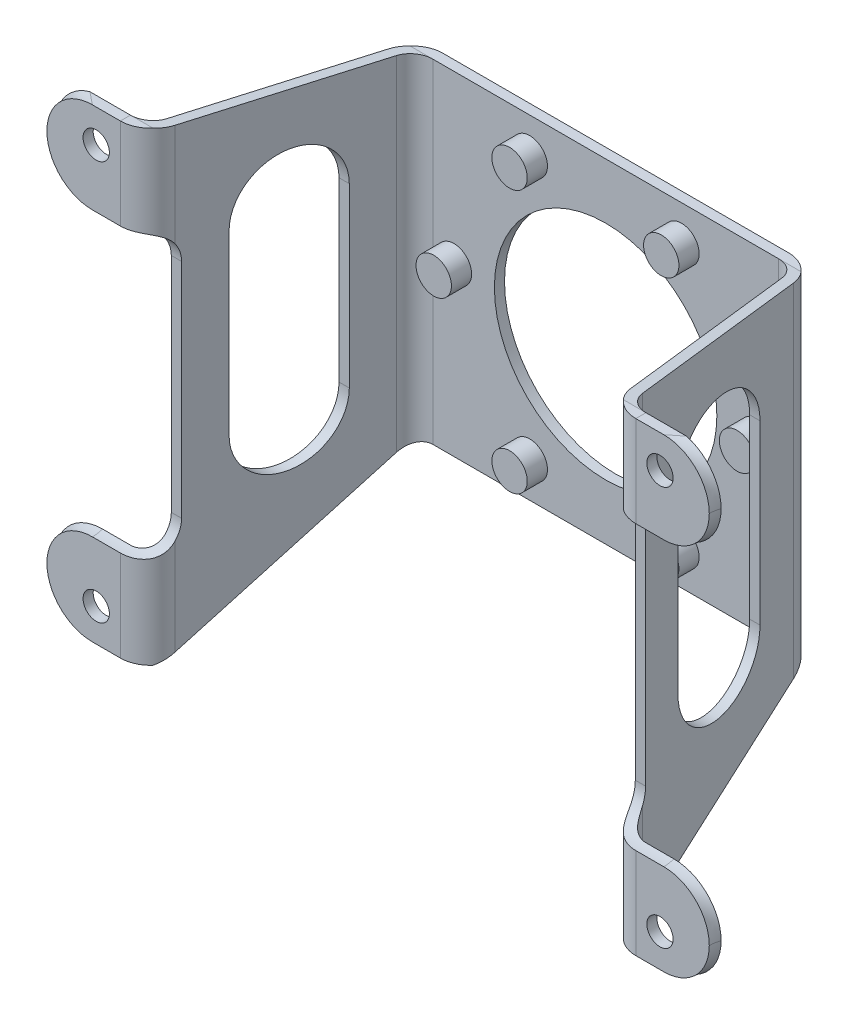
ISO-10303-21;
HEADER;
FILE_DESCRIPTION(('STEP AP214'),'2;1');
FILE_NAME('part.step','',(''),(''),'','','');
FILE_SCHEMA(('AUTOMOTIVE_DESIGN { 1 0 10303 214 1 1 1 1 }'));
ENDSEC;
DATA;
#1=APPLICATION_CONTEXT('core data for automotive mechanical design processes');
#2=APPLICATION_PROTOCOL_DEFINITION('international standard','automotive_design',2000,#1);
#3=PRODUCT_CONTEXT('',#1,'mechanical');
#4=PRODUCT('Part','Part','',(#3));
#5=PRODUCT_RELATED_PRODUCT_CATEGORY('part','',(#4));
#6=PRODUCT_DEFINITION_FORMATION('','',#4);
#7=PRODUCT_DEFINITION_CONTEXT('part definition',#1,'design');
#8=PRODUCT_DEFINITION('design','',#6,#7);
#9=PRODUCT_DEFINITION_SHAPE('','',#8);
#10=(LENGTH_UNIT() NAMED_UNIT(*) SI_UNIT(.MILLI.,.METRE.));
#11=(NAMED_UNIT(*) PLANE_ANGLE_UNIT() SI_UNIT($,.RADIAN.));
#12=(NAMED_UNIT(*) SI_UNIT($,.STERADIAN.) SOLID_ANGLE_UNIT());
#13=UNCERTAINTY_MEASURE_WITH_UNIT(LENGTH_MEASURE(1.E-05),#10,'distance_accuracy_value','');
#14=(GEOMETRIC_REPRESENTATION_CONTEXT(3) GLOBAL_UNCERTAINTY_ASSIGNED_CONTEXT((#13)) GLOBAL_UNIT_ASSIGNED_CONTEXT((#10,
#11,#12)) REPRESENTATION_CONTEXT('',''));
#15=CARTESIAN_POINT('',(0.,0.,0.));
#16=DIRECTION('',(0.,0.,1.));
#17=DIRECTION('',(1.,0.,0.));
#18=AXIS2_PLACEMENT_3D('',#15,#16,#17);
#19=CARTESIAN_POINT('',(-37.5,-55.5,0.));
#20=DIRECTION('',(0.,0.,1.));
#21=DIRECTION('',(1.,0.,0.));
#22=AXIS2_PLACEMENT_3D('',#19,#20,#21);
#23=PLANE('',#22);
#24=CARTESIAN_POINT('',(14.9999999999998,-25.9807621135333,0.));
#25=DIRECTION('',(0.,0.,1.));
#26=DIRECTION('',(1.,0.,0.));
#27=AXIS2_PLACEMENT_3D('',#24,#25,#26);
#28=CIRCLE('',#27,3.5);
#29=CARTESIAN_POINT('',(18.4999999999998,-25.9807621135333,0.));
#30=VERTEX_POINT('',#29);
#31=EDGE_CURVE('E1522',#30,#30,#28,.T.);
#32=ORIENTED_EDGE('',*,*,#31,.F.);
#33=EDGE_LOOP('',(#32));
#34=FACE_BOUND('',#33,.T.);
#35=CARTESIAN_POINT('',(15.0000000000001,25.9807621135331,0.));
#36=DIRECTION('',(0.,0.,1.));
#37=DIRECTION('',(1.,0.,0.));
#38=AXIS2_PLACEMENT_3D('',#35,#36,#37);
#39=CIRCLE('',#38,3.5);
#40=CARTESIAN_POINT('',(18.5000000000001,25.9807621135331,0.));
#41=VERTEX_POINT('',#40);
#42=EDGE_CURVE('E1537',#41,#41,#39,.T.);
#43=ORIENTED_EDGE('',*,*,#42,.F.);
#44=EDGE_LOOP('',(#43));
#45=FACE_BOUND('',#44,.T.);
#46=CARTESIAN_POINT('',(-30.,0.,0.));
#47=DIRECTION('',(0.,0.,1.));
#48=DIRECTION('',(1.,0.,0.));
#49=AXIS2_PLACEMENT_3D('',#46,#47,#48);
#50=CIRCLE('',#49,3.5);
#51=CARTESIAN_POINT('',(-26.5,0.,0.));
#52=VERTEX_POINT('',#51);
#53=EDGE_CURVE('E875',#52,#52,#50,.T.);
#54=ORIENTED_EDGE('',*,*,#53,.F.);
#55=EDGE_LOOP('',(#54));
#56=FACE_BOUND('',#55,.T.);
#57=DIRECTION('',(1.,0.,0.));
#58=VECTOR('',#57,1.);
#59=CARTESIAN_POINT('',(-65.5,-33.,0.));
#60=LINE('',#59,#58);
#61=CARTESIAN_POINT('',(-34.1848229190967,-33.,0.));
#62=VERTEX_POINT('',#61);
#63=CARTESIAN_POINT('',(34.1848229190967,-33.,0.));
#64=VERTEX_POINT('',#63);
#65=EDGE_CURVE('E458',#62,#64,#60,.T.);
#66=ORIENTED_EDGE('',*,*,#65,.T.);
#67=DIRECTION('',(0.,1.,0.));
#68=VECTOR('',#67,1.);
#69=CARTESIAN_POINT('',(34.1848229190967,36.5,0.));
#70=LINE('',#69,#68);
#71=CARTESIAN_POINT('',(34.1848229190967,33.,0.));
#72=VERTEX_POINT('',#71);
#73=EDGE_CURVE('E584',#64,#72,#70,.T.);
#74=ORIENTED_EDGE('',*,*,#73,.T.);
#75=DIRECTION('',(1.,0.,0.));
#76=VECTOR('',#75,1.);
#77=CARTESIAN_POINT('',(-65.5,33.,0.));
#78=LINE('',#77,#76);
#79=CARTESIAN_POINT('',(-34.1848229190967,33.,0.));
#80=VERTEX_POINT('',#79);
#81=EDGE_CURVE('E500',#80,#72,#78,.T.);
#82=ORIENTED_EDGE('',*,*,#81,.F.);
#83=DIRECTION('',(0.,1.,0.));
#84=VECTOR('',#83,1.);
#85=CARTESIAN_POINT('',(-34.1848229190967,-55.5,0.));
#86=LINE('',#85,#84);
#87=EDGE_CURVE('E581',#80,#62,#86,.F.);
#88=ORIENTED_EDGE('',*,*,#87,.T.);
#89=EDGE_LOOP('',(#66,#74,#82,#88));
#90=FACE_BOUND('',#89,.T.);
#91=CARTESIAN_POINT('',(0.,0.,0.));
#92=DIRECTION('',(0.,0.,1.));
#93=DIRECTION('',(1.,0.,0.));
#94=AXIS2_PLACEMENT_3D('',#91,#92,#93);
#95=CIRCLE('',#94,22.);
#96=CARTESIAN_POINT('',(22.,0.,0.));
#97=VERTEX_POINT('',#96);
#98=EDGE_CURVE('E535',#97,#97,#95,.T.);
#99=ORIENTED_EDGE('',*,*,#98,.F.);
#100=EDGE_LOOP('',(#99));
#101=FACE_BOUND('',#100,.T.);
#102=CARTESIAN_POINT('',(-14.9999999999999,25.9807621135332,0.));
#103=DIRECTION('',(0.,0.,1.));
#104=DIRECTION('',(1.,0.,0.));
#105=AXIS2_PLACEMENT_3D('',#102,#103,#104);
#106=CIRCLE('',#105,3.5);
#107=CARTESIAN_POINT('',(-11.4999999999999,25.9807621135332,0.));
#108=VERTEX_POINT('',#107);
#109=EDGE_CURVE('E1543',#108,#108,#106,.T.);
#110=ORIENTED_EDGE('',*,*,#109,.F.);
#111=EDGE_LOOP('',(#110));
#112=FACE_BOUND('',#111,.T.);
#113=CARTESIAN_POINT('',(30.,-2.09489001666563E-13,0.));
#114=DIRECTION('',(0.,0.,1.));
#115=DIRECTION('',(1.,0.,0.));
#116=AXIS2_PLACEMENT_3D('',#113,#114,#115);
#117=CIRCLE('',#116,3.5);
#118=CARTESIAN_POINT('',(33.5,-2.09489001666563E-13,0.));
#119=VERTEX_POINT('',#118);
#120=EDGE_CURVE('E1532',#119,#119,#117,.T.);
#121=ORIENTED_EDGE('',*,*,#120,.F.);
#122=EDGE_LOOP('',(#121));
#123=FACE_BOUND('',#122,.T.);
#124=CARTESIAN_POINT('',(-15.0000000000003,-25.980762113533,0.));
#125=DIRECTION('',(0.,0.,1.));
#126=DIRECTION('',(1.,0.,0.));
#127=AXIS2_PLACEMENT_3D('',#124,#125,#126);
#128=CIRCLE('',#127,3.5);
#129=CARTESIAN_POINT('',(-11.5000000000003,-25.980762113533,0.));
#130=VERTEX_POINT('',#129);
#131=EDGE_CURVE('E1523',#130,#130,#128,.T.);
#132=ORIENTED_EDGE('',*,*,#131,.F.);
#133=EDGE_LOOP('',(#132));
#134=FACE_BOUND('',#133,.T.);
#135=ADVANCED_FACE('F38',(#34,#45,#56,#90,#101,#112,#123,#134),#23,.T.);
#136=CARTESIAN_POINT('',(46.,-55.5,45.));
#137=DIRECTION('',(0.,0.,1.));
#138=DIRECTION('',(1.,0.,0.));
#139=AXIS2_PLACEMENT_3D('',#136,#137,#138);
#140=PLANE('',#139);
#141=CARTESIAN_POINT('',(55.75,30.,45.));
#142=DIRECTION('',(0.,0.,1.));
#143=DIRECTION('',(1.,0.,0.));
#144=AXIS2_PLACEMENT_3D('',#141,#142,#143);
#145=CIRCLE('',#144,2.6);
#146=CARTESIAN_POINT('',(58.35,30.,45.));
#147=VERTEX_POINT('',#146);
#148=EDGE_CURVE('E420',#147,#147,#145,.T.);
#149=ORIENTED_EDGE('',*,*,#148,.F.);
#150=EDGE_LOOP('',(#149));
#151=FACE_BOUND('',#150,.T.);
#152=DIRECTION('',(1.,0.,0.));
#153=VECTOR('',#152,1.);
#154=CARTESIAN_POINT('',(-65.5,18.5,45.));
#155=LINE('',#154,#153);
#156=CARTESIAN_POINT('',(50.9727656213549,18.5,45.));
#157=VERTEX_POINT('',#156);
#158=CARTESIAN_POINT('',(56.5,18.5,45.));
#159=VERTEX_POINT('',#158);
#160=EDGE_CURVE('E436',#157,#159,#155,.T.);
#161=ORIENTED_EDGE('',*,*,#160,.T.);
#162=CARTESIAN_POINT('',(56.5,27.5,45.));
#163=DIRECTION('',(0.,0.,1.));
#164=DIRECTION('',(1.,0.,0.));
#165=AXIS2_PLACEMENT_3D('',#162,#163,#164);
#166=CIRCLE('',#165,9.);
#167=CARTESIAN_POINT('',(65.5,27.5,45.));
#168=VERTEX_POINT('',#167);
#169=EDGE_CURVE('E642',#159,#168,#166,.T.);
#170=ORIENTED_EDGE('',*,*,#169,.T.);
#171=CARTESIAN_POINT('',(56.5,27.5,45.));
#172=DIRECTION('',(0.,0.,1.));
#173=DIRECTION('',(1.,0.,0.));
#174=AXIS2_PLACEMENT_3D('',#171,#172,#173);
#175=CIRCLE('',#174,9.);
#176=CARTESIAN_POINT('',(56.5,36.5,45.));
#177=VERTEX_POINT('',#176);
#178=EDGE_CURVE('E640',#168,#177,#175,.T.);
#179=ORIENTED_EDGE('',*,*,#178,.T.);
#180=DIRECTION('',(1.,0.,0.));
#181=VECTOR('',#180,1.);
#182=CARTESIAN_POINT('',(46.,36.5,45.));
#183=LINE('',#182,#181);
#184=CARTESIAN_POINT('',(50.9727656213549,36.5,45.));
#185=VERTEX_POINT('',#184);
#186=EDGE_CURVE('E547',#185,#177,#183,.T.);
#187=ORIENTED_EDGE('',*,*,#186,.F.);
#188=DIRECTION('',(0.,1.,0.));
#189=VECTOR('',#188,1.);
#190=CARTESIAN_POINT('',(50.9727656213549,-55.5,45.));
#191=LINE('',#190,#189);
#192=EDGE_CURVE('E570',#185,#157,#191,.F.);
#193=ORIENTED_EDGE('',*,*,#192,.T.);
#194=EDGE_LOOP('',(#161,#170,#179,#187,#193));
#195=FACE_BOUND('',#194,.T.);
#196=ADVANCED_FACE('F780',(#151,#195),#140,.T.);
#197=CARTESIAN_POINT('',(-65.5,-55.5,45.));
#198=DIRECTION('',(0.,0.,1.));
#199=DIRECTION('',(1.,0.,0.));
#200=AXIS2_PLACEMENT_3D('',#197,#198,#199);
#201=PLANE('',#200);
#202=CARTESIAN_POINT('',(-55.75,30.,45.));
#203=DIRECTION('',(0.,0.,1.));
#204=DIRECTION('',(1.,0.,0.));
#205=AXIS2_PLACEMENT_3D('',#202,#203,#204);
#206=CIRCLE('',#205,2.6);
#207=CARTESIAN_POINT('',(-53.15,30.,45.));
#208=VERTEX_POINT('',#207);
#209=EDGE_CURVE('E426',#208,#208,#206,.T.);
#210=ORIENTED_EDGE('',*,*,#209,.F.);
#211=EDGE_LOOP('',(#210));
#212=FACE_BOUND('',#211,.T.);
#213=CARTESIAN_POINT('',(-56.5,27.5,45.));
#214=DIRECTION('',(0.,0.,1.));
#215=DIRECTION('',(1.,0.,0.));
#216=AXIS2_PLACEMENT_3D('',#213,#214,#215);
#217=CIRCLE('',#216,9.);
#218=CARTESIAN_POINT('',(-56.5,36.5,45.));
#219=VERTEX_POINT('',#218);
#220=CARTESIAN_POINT('',(-65.5,27.5,45.));
#221=VERTEX_POINT('',#220);
#222=EDGE_CURVE('E653',#219,#221,#217,.T.);
#223=ORIENTED_EDGE('',*,*,#222,.T.);
#224=CARTESIAN_POINT('',(-56.5,27.5,45.));
#225=DIRECTION('',(0.,0.,1.));
#226=DIRECTION('',(1.,0.,0.));
#227=AXIS2_PLACEMENT_3D('',#224,#225,#226);
#228=CIRCLE('',#227,9.);
#229=CARTESIAN_POINT('',(-56.5,18.5,45.));
#230=VERTEX_POINT('',#229);
#231=EDGE_CURVE('E656',#221,#230,#228,.T.);
#232=ORIENTED_EDGE('',*,*,#231,.T.);
#233=CARTESIAN_POINT('',(-50.9727656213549,18.5,45.));
#234=VERTEX_POINT('',#233);
#235=EDGE_CURVE('E433',#230,#234,#155,.T.);
#236=ORIENTED_EDGE('',*,*,#235,.T.);
#237=DIRECTION('',(0.,1.,0.));
#238=VECTOR('',#237,1.);
#239=CARTESIAN_POINT('',(-50.9727656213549,-55.5,45.));
#240=LINE('',#239,#238);
#241=CARTESIAN_POINT('',(-50.9727656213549,36.5,45.));
#242=VERTEX_POINT('',#241);
#243=EDGE_CURVE('E553',#234,#242,#240,.T.);
#244=ORIENTED_EDGE('',*,*,#243,.T.);
#245=DIRECTION('',(1.,0.,0.));
#246=VECTOR('',#245,1.);
#247=CARTESIAN_POINT('',(-65.5,36.5,45.));
#248=LINE('',#247,#246);
#249=EDGE_CURVE('E542',#219,#242,#248,.T.);
#250=ORIENTED_EDGE('',*,*,#249,.F.);
#251=EDGE_LOOP('',(#223,#232,#236,#244,#250));
#252=FACE_BOUND('',#251,.T.);
#253=ADVANCED_FACE('F786',(#212,#252),#201,.T.);
#254=CARTESIAN_POINT('',(-50.9727656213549,-55.5,39.));
#255=DIRECTION('',(0.,1.,0.));
#256=DIRECTION('',(0.,0.,1.));
#257=AXIS2_PLACEMENT_3D('',#254,#255,#256);
#258=CYLINDRICAL_SURFACE('',#257,6.);
#259=ORIENTED_EDGE('',*,*,#243,.F.);
#260=CARTESIAN_POINT('',(-50.9727656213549,18.5,45.));
#261=CARTESIAN_POINT('',(-50.8892362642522,18.4999975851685,44.9999999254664));
#262=CARTESIAN_POINT('',(-50.8057168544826,18.5000003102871,44.9982554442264));
#263=CARTESIAN_POINT('',(-50.6388257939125,18.4999951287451,44.9912820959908));
#264=CARTESIAN_POINT('',(-50.5554541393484,18.4999872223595,44.9860533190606));
#265=CARTESIAN_POINT('',(-50.3057813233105,18.4999162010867,44.9651499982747));
#266=CARTESIAN_POINT('',(-50.1398868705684,18.4998058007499,44.9442584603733));
#267=CARTESIAN_POINT('',(-49.8101886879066,18.4990310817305,44.8886683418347));
#268=CARTESIAN_POINT('',(-49.6463885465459,18.4983659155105,44.8539486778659));
#269=CARTESIAN_POINT('',(-49.322265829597,18.4957700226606,44.7709471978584));
#270=CARTESIAN_POINT('',(-49.1619432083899,18.4938393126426,44.7226655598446));
#271=CARTESIAN_POINT('',(-48.8457496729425,18.4877478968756,44.6128286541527));
#272=CARTESIAN_POINT('',(-48.6898839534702,18.4835846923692,44.5512585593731));
#273=CARTESIAN_POINT('',(-48.3839554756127,18.4718372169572,44.415355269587));
#274=CARTESIAN_POINT('',(-48.2338923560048,18.4642531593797,44.3410228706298));
#275=CARTESIAN_POINT('',(-47.9408046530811,18.4442902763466,44.1802637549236));
#276=CARTESIAN_POINT('',(-47.7977767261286,18.4319137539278,44.0938428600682));
#277=CARTESIAN_POINT('',(-47.5198864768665,18.4008482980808,43.9097247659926));
#278=CARTESIAN_POINT('',(-47.3850236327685,18.3821597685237,43.8120282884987));
#279=CARTESIAN_POINT('',(-47.129709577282,18.3377570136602,43.6104598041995));
#280=CARTESIAN_POINT('',(-47.0089026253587,18.3123426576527,43.506973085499));
#281=CARTESIAN_POINT('',(-46.7769949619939,18.2528146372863,43.2919119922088));
#282=CARTESIAN_POINT('',(-46.6658940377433,18.2187011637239,43.1803377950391));
#283=CARTESIAN_POINT('',(-46.4545630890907,18.1405758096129,42.9509638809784));
#284=CARTESIAN_POINT('',(-46.3543122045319,18.0965834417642,42.8331767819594));
#285=CARTESIAN_POINT('',(-46.1652093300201,17.9976276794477,42.5931507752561));
#286=CARTESIAN_POINT('',(-46.0763552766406,17.9426662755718,42.4709126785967));
#287=CARTESIAN_POINT('',(-45.921842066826,17.8294001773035,42.2410881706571));
#288=CARTESIAN_POINT('',(-45.854672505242,17.7725784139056,42.1337819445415));
#289=CARTESIAN_POINT('',(-45.7292336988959,17.6500481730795,41.9190460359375));
#290=CARTESIAN_POINT('',(-45.670963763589,17.5843403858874,41.8116163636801));
#291=CARTESIAN_POINT('',(-45.5630729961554,17.4439579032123,41.5979941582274));
#292=CARTESIAN_POINT('',(-45.5134665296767,17.3692686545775,41.4918039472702));
#293=CARTESIAN_POINT('',(-45.4226240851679,17.2112663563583,41.282315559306));
#294=CARTESIAN_POINT('',(-45.3813874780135,17.1279539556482,41.1790171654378));
#295=CARTESIAN_POINT('',(-45.3112198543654,16.9637663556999,40.9889407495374));
#296=CARTESIAN_POINT('',(-45.2814025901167,16.8838238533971,40.9016799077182));
#297=CARTESIAN_POINT('',(-45.2272499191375,16.7179942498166,40.7311984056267));
#298=CARTESIAN_POINT('',(-45.2029146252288,16.6321070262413,40.6479778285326));
#299=CARTESIAN_POINT('',(-45.1592114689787,16.4550356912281,40.4864639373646));
#300=CARTESIAN_POINT('',(-45.139831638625,16.3638650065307,40.4081591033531));
#301=CARTESIAN_POINT('',(-45.1053624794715,16.1765180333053,40.25681954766));
#302=CARTESIAN_POINT('',(-45.0902719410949,16.0803431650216,40.1837833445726));
#303=CARTESIAN_POINT('',(-45.0770210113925,15.9818805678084,40.1136406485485));
#304=B_SPLINE_CURVE_WITH_KNOTS('',3,(#260,#261,#262,#263,#264,#265,#266,#267,#268,#269,#270,
#271,#272,#273,#274,#275,#276,#277,#278,#279,#280,#281,#282,#283,#284,#285,#286,#287,#288,#289,
#290,#291,#292,#293,#294,#295,#296,#297,#298,#299,#300,#301,#302,#303),.UNSPECIFIED.,.F.,.F.,(4,
2,2,2,2,2,2,2,2,2,2,2,2,2,2,2,2,2,2,2,2,4),(0.,0.250549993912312,0.501093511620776,
1.0020745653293,1.50382239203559,2.0055636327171,2.50786763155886,3.01014031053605,
3.51217191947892,4.0141714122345,4.49674439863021,4.97930680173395,5.46092430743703,
5.9424544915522,6.35818976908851,6.77389277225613,7.19027867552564,7.60663326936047,
7.97242560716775,8.33822547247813,8.70313336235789,9.06793824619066),.UNSPECIFIED.);
#305=CARTESIAN_POINT('',(-45.0770210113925,15.9818805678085,40.1136406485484));
#306=VERTEX_POINT('',#305);
#307=EDGE_CURVE('E698',#234,#306,#304,.T.);
#308=ORIENTED_EDGE('',*,*,#307,.T.);
#309=DIRECTION('',(0.,1.,0.));
#310=VECTOR('',#309,1.);
#311=CARTESIAN_POINT('',(-45.0770210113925,-55.5,40.1136406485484));
#312=LINE('',#311,#310);
#313=CARTESIAN_POINT('',(-45.0770210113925,36.2650637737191,40.1136406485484));
#314=VERTEX_POINT('',#313);
#315=EDGE_CURVE('E558',#314,#306,#312,.F.);
#316=ORIENTED_EDGE('',*,*,#315,.F.);
#317=CARTESIAN_POINT('',(-50.9727656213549,36.1744186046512,39.));
#318=DIRECTION('',(0.,-0.996703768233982,0.0811270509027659));
#319=DIRECTION('',(0.,0.0811270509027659,0.996703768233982));
#320=AXIS2_PLACEMENT_3D('',#317,#318,#319);
#321=ELLIPSE('',#320,6.01984279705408,6.);
#322=CARTESIAN_POINT('',(-46.5006296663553,36.5,43.));
#323=VERTEX_POINT('',#322);
#324=EDGE_CURVE('E531',#323,#314,#321,.F.);
#325=ORIENTED_EDGE('',*,*,#324,.F.);
#326=CARTESIAN_POINT('',(-50.9727656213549,36.5,39.));
#327=DIRECTION('',(0.,1.,0.));
#328=DIRECTION('',(0.,0.,1.));
#329=AXIS2_PLACEMENT_3D('',#326,#327,#328);
#330=CIRCLE('',#329,6.);
#331=EDGE_CURVE('E561',#323,#242,#330,.F.);
#332=ORIENTED_EDGE('',*,*,#331,.T.);
#333=EDGE_LOOP('',(#259,#308,#316,#325,#332));
#334=FACE_BOUND('',#333,.T.);
#335=ADVANCED_FACE('F691',(#334),#258,.T.);
#336=CARTESIAN_POINT('',(50.9727656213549,-55.5,39.));
#337=DIRECTION('',(0.,1.,0.));
#338=DIRECTION('',(0.,0.,1.));
#339=AXIS2_PLACEMENT_3D('',#336,#337,#338);
#340=CYLINDRICAL_SURFACE('',#339,6.);
#341=DIRECTION('',(0.,1.,0.));
#342=VECTOR('',#341,1.);
#343=CARTESIAN_POINT('',(45.0770210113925,-55.5,40.1136406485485));
#344=LINE('',#343,#342);
#345=CARTESIAN_POINT('',(45.0770210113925,15.9818805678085,40.1136406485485));
#346=VERTEX_POINT('',#345);
#347=CARTESIAN_POINT('',(45.0770210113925,36.2650637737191,40.1136406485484));
#348=VERTEX_POINT('',#347);
#349=EDGE_CURVE('E560',#346,#348,#344,.T.);
#350=ORIENTED_EDGE('',*,*,#349,.F.);
#351=CARTESIAN_POINT('',(45.0770210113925,15.9818805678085,40.1136406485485));
#352=CARTESIAN_POINT('',(45.0920281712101,16.0934084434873,40.1930799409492));
#353=CARTESIAN_POINT('',(45.1093982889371,16.2019996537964,40.2762455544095));
#354=CARTESIAN_POINT('',(45.1497476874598,16.4127109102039,40.4492634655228));
#355=CARTESIAN_POINT('',(45.1727300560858,16.5148273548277,40.5391194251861));
#356=CARTESIAN_POINT('',(45.2252019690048,16.7119772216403,40.7247666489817));
#357=CARTESIAN_POINT('',(45.2546987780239,16.8070025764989,40.8205644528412));
#358=CARTESIAN_POINT('',(45.3209783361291,16.9892248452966,41.0169369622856));
#359=CARTESIAN_POINT('',(45.3577595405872,17.0764234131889,41.1175106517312));
#360=CARTESIAN_POINT('',(45.4394730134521,17.2428859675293,41.3226961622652));
#361=CARTESIAN_POINT('',(45.484441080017,17.3221126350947,41.4273240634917));
#362=CARTESIAN_POINT('',(45.5829289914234,17.4718324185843,41.6387996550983));
#363=CARTESIAN_POINT('',(45.6364493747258,17.5423249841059,41.7456474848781));
#364=CARTESIAN_POINT('',(45.7522155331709,17.674283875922,41.959838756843));
#365=CARTESIAN_POINT('',(45.8144440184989,17.7357676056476,42.0671808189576));
#366=CARTESIAN_POINT('',(45.9477561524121,17.8499429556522,42.2810290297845));
#367=CARTESIAN_POINT('',(46.0188393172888,17.902635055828,42.3875352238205));
#368=CARTESIAN_POINT('',(46.1653626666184,17.9967613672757,42.5921858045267));
#369=CARTESIAN_POINT('',(46.2403202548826,18.0386674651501,42.6904597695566));
#370=CARTESIAN_POINT('',(46.3976433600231,18.1153762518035,42.8837850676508));
#371=CARTESIAN_POINT('',(46.4800086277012,18.1501791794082,42.9788365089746));
#372=CARTESIAN_POINT('',(46.6517933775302,18.213277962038,43.1647607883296));
#373=CARTESIAN_POINT('',(46.7412183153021,18.2415687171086,43.2556303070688));
#374=CARTESIAN_POINT('',(46.9265960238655,18.2922908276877,43.4322579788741));
#375=CARTESIAN_POINT('',(47.022551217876,18.3147199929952,43.518014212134));
#376=CARTESIAN_POINT('',(47.2255181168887,18.3554636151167,43.6879145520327));
#377=CARTESIAN_POINT('',(47.3328448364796,18.3735061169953,43.7717472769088));
#378=CARTESIAN_POINT('',(47.5534583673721,18.4047921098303,43.9322364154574));
#379=CARTESIAN_POINT('',(47.6667476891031,18.4180335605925,44.0088897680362));
#380=CARTESIAN_POINT('',(47.8986053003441,18.4405773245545,44.1544426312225));
#381=CARTESIAN_POINT('',(48.0171747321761,18.4498787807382,44.223340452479));
#382=CARTESIAN_POINT('',(48.2589168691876,18.465363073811,44.352927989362));
#383=CARTESIAN_POINT('',(48.3820899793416,18.4715456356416,44.4136169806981));
#384=CARTESIAN_POINT('',(48.6492999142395,18.482226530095,44.5340566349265));
#385=CARTESIAN_POINT('',(48.7939078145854,18.4863846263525,44.5925735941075));
#386=CARTESIAN_POINT('',(49.0873008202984,18.4926378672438,44.6981873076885));
#387=CARTESIAN_POINT('',(49.2360866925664,18.4947326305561,44.7452819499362));
#388=CARTESIAN_POINT('',(49.5367567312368,18.4976674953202,44.8277060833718));
#389=CARTESIAN_POINT('',(49.6886381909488,18.4985086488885,44.8630454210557));
#390=CARTESIAN_POINT('',(49.9946382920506,18.4995620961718,44.9217839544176));
#391=CARTESIAN_POINT('',(50.148755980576,18.4997746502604,44.9451880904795));
#392=CARTESIAN_POINT('',(50.4147063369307,18.4999611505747,44.9750387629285));
#393=CARTESIAN_POINT('',(50.526220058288,18.4999854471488,44.9844050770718));
#394=CARTESIAN_POINT('',(50.7494083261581,18.4999999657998,44.9968815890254));
#395=CARTESIAN_POINT('',(50.8610822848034,18.4999902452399,45.0000023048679));
#396=CARTESIAN_POINT('',(50.9727656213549,18.5,45.));
#397=B_SPLINE_CURVE_WITH_KNOTS('',3,(#351,#352,#353,#354,#355,#356,#357,#358,#359,#360,#361,
#362,#363,#364,#365,#366,#367,#368,#369,#370,#371,#372,#373,#374,#375,#376,#377,#378,#379,#380,
#381,#382,#383,#384,#385,#386,#387,#388,#389,#390,#391,#392,#393,#394,#395,#396),.UNSPECIFIED.,
.F.,.F.,(4,2,2,2,2,2,2,2,2,2,2,2,2,2,2,2,2,2,2,2,2,2,4),(0.,0.413185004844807,0.826597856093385,
1.24047408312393,1.65426264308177,2.06990601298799,2.48557556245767,2.90043121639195,
3.31526421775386,3.70634214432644,4.09740691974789,4.48877692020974,4.88029294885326,
5.29200614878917,5.70389410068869,6.11587159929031,6.52788542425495,6.99554423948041,
7.46328946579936,7.93064190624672,8.39780073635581,8.73335416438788,9.06834201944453),.UNSPECIFIED.);
#398=EDGE_CURVE('E706',#346,#157,#397,.T.);
#399=ORIENTED_EDGE('',*,*,#398,.T.);
#400=ORIENTED_EDGE('',*,*,#192,.F.);
#401=CARTESIAN_POINT('',(50.9727656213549,36.5,39.));
#402=DIRECTION('',(0.,1.,0.));
#403=DIRECTION('',(0.,0.,1.));
#404=AXIS2_PLACEMENT_3D('',#401,#402,#403);
#405=CIRCLE('',#404,6.);
#406=CARTESIAN_POINT('',(46.5006296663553,36.5,43.));
#407=VERTEX_POINT('',#406);
#408=EDGE_CURVE('E574',#185,#407,#405,.F.);
#409=ORIENTED_EDGE('',*,*,#408,.T.);
#410=CARTESIAN_POINT('',(50.9727656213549,36.1744186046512,39.));
#411=DIRECTION('',(0.,-0.996703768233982,0.0811270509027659));
#412=DIRECTION('',(0.,0.0811270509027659,0.996703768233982));
#413=AXIS2_PLACEMENT_3D('',#410,#411,#412);
#414=ELLIPSE('',#413,6.01984279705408,6.);
#415=EDGE_CURVE('E523',#348,#407,#414,.F.);
#416=ORIENTED_EDGE('',*,*,#415,.F.);
#417=EDGE_LOOP('',(#350,#399,#400,#409,#416));
#418=FACE_BOUND('',#417,.T.);
#419=ADVANCED_FACE('F813',(#418),#340,.T.);
#420=CARTESIAN_POINT('',(46.,-55.5,43.));
#421=DIRECTION('',(0.,0.,1.));
#422=DIRECTION('',(1.,0.,0.));
#423=AXIS2_PLACEMENT_3D('',#420,#421,#422);
#424=PLANE('',#423);
#425=CARTESIAN_POINT('',(55.75,30.,43.));
#426=DIRECTION('',(0.,0.,1.));
#427=DIRECTION('',(1.,0.,0.));
#428=AXIS2_PLACEMENT_3D('',#425,#426,#427);
#429=CIRCLE('',#428,2.6);
#430=CARTESIAN_POINT('',(58.35,30.,43.));
#431=VERTEX_POINT('',#430);
#432=EDGE_CURVE('E423',#431,#431,#429,.F.);
#433=ORIENTED_EDGE('',*,*,#432,.F.);
#434=EDGE_LOOP('',(#433));
#435=FACE_BOUND('',#434,.T.);
#436=DIRECTION('',(1.,0.,0.));
#437=VECTOR('',#436,1.);
#438=CARTESIAN_POINT('',(46.,36.5,43.));
#439=LINE('',#438,#437);
#440=CARTESIAN_POINT('',(50.9727656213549,36.5,43.));
#441=VERTEX_POINT('',#440);
#442=CARTESIAN_POINT('',(59.0088588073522,36.5,43.));
#443=VERTEX_POINT('',#442);
#444=EDGE_CURVE('E611',#441,#443,#439,.T.);
#445=ORIENTED_EDGE('',*,*,#444,.T.);
#446=CARTESIAN_POINT('',(56.5,27.5,43.));
#447=DIRECTION('',(0.,0.,-1.));
#448=DIRECTION('',(0.,1.,0.));
#449=AXIS2_PLACEMENT_3D('',#446,#447,#448);
#450=CIRCLE('',#449,9.34314575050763);
#451=CARTESIAN_POINT('',(65.8431457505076,27.5,43.));
#452=VERTEX_POINT('',#451);
#453=EDGE_CURVE('E1118',#443,#452,#450,.T.);
#454=ORIENTED_EDGE('',*,*,#453,.T.);
#455=CARTESIAN_POINT('',(56.5,27.5,43.));
#456=DIRECTION('',(0.,0.,-1.));
#457=DIRECTION('',(0.,1.,0.));
#458=AXIS2_PLACEMENT_3D('',#455,#456,#457);
#459=CIRCLE('',#458,9.34314575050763);
#460=CARTESIAN_POINT('',(56.5,18.1568542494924,43.));
#461=VERTEX_POINT('',#460);
#462=EDGE_CURVE('E1119',#452,#461,#459,.T.);
#463=ORIENTED_EDGE('',*,*,#462,.T.);
#464=DIRECTION('',(-1.,0.,0.));
#465=VECTOR('',#464,1.);
#466=CARTESIAN_POINT('',(56.5,18.1568542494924,43.));
#467=LINE('',#466,#465);
#468=CARTESIAN_POINT('',(50.9727656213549,18.1568542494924,43.));
#469=VERTEX_POINT('',#468);
#470=EDGE_CURVE('E1146',#461,#469,#467,.T.);
#471=ORIENTED_EDGE('',*,*,#470,.T.);
#472=DIRECTION('',(0.,1.,0.));
#473=VECTOR('',#472,1.);
#474=CARTESIAN_POINT('',(50.9727656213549,-55.5,43.));
#475=LINE('',#474,#473);
#476=EDGE_CURVE('E590',#441,#469,#475,.F.);
#477=ORIENTED_EDGE('',*,*,#476,.F.);
#478=EDGE_LOOP('',(#445,#454,#463,#471,#477));
#479=FACE_BOUND('',#478,.T.);
#480=ADVANCED_FACE('F1154',(#435,#479),#424,.F.);
#481=CARTESIAN_POINT('',(-65.5,-55.5,43.));
#482=DIRECTION('',(0.,0.,1.));
#483=DIRECTION('',(1.,0.,0.));
#484=AXIS2_PLACEMENT_3D('',#481,#482,#483);
#485=PLANE('',#484);
#486=CARTESIAN_POINT('',(-55.75,30.,43.));
#487=DIRECTION('',(0.,0.,1.));
#488=DIRECTION('',(1.,0.,0.));
#489=AXIS2_PLACEMENT_3D('',#486,#487,#488);
#490=CIRCLE('',#489,2.6);
#491=CARTESIAN_POINT('',(-53.15,30.,43.));
#492=VERTEX_POINT('',#491);
#493=EDGE_CURVE('E429',#492,#492,#490,.F.);
#494=ORIENTED_EDGE('',*,*,#493,.F.);
#495=EDGE_LOOP('',(#494));
#496=FACE_BOUND('',#495,.T.);
#497=CARTESIAN_POINT('',(-56.5,27.5,43.));
#498=DIRECTION('',(0.,0.,-1.));
#499=DIRECTION('',(0.,1.,0.));
#500=AXIS2_PLACEMENT_3D('',#497,#498,#499);
#501=CIRCLE('',#500,9.34314575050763);
#502=CARTESIAN_POINT('',(-56.5,18.1568542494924,43.));
#503=VERTEX_POINT('',#502);
#504=CARTESIAN_POINT('',(-65.8431457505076,27.5,43.));
#505=VERTEX_POINT('',#504);
#506=EDGE_CURVE('E837',#503,#505,#501,.T.);
#507=ORIENTED_EDGE('',*,*,#506,.T.);
#508=CARTESIAN_POINT('',(-56.5,27.5,43.));
#509=DIRECTION('',(0.,0.,-1.));
#510=DIRECTION('',(0.,1.,0.));
#511=AXIS2_PLACEMENT_3D('',#508,#509,#510);
#512=CIRCLE('',#511,9.34314575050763);
#513=CARTESIAN_POINT('',(-59.0088588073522,36.5,43.));
#514=VERTEX_POINT('',#513);
#515=EDGE_CURVE('E829',#505,#514,#512,.T.);
#516=ORIENTED_EDGE('',*,*,#515,.T.);
#517=DIRECTION('',(1.,0.,0.));
#518=VECTOR('',#517,1.);
#519=CARTESIAN_POINT('',(-65.5,36.5,43.));
#520=LINE('',#519,#518);
#521=CARTESIAN_POINT('',(-50.9727656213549,36.5,43.));
#522=VERTEX_POINT('',#521);
#523=EDGE_CURVE('E539',#514,#522,#520,.T.);
#524=ORIENTED_EDGE('',*,*,#523,.T.);
#525=DIRECTION('',(0.,1.,0.));
#526=VECTOR('',#525,1.);
#527=CARTESIAN_POINT('',(-50.9727656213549,-55.5,43.));
#528=LINE('',#527,#526);
#529=CARTESIAN_POINT('',(-50.9727656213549,18.1568542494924,43.));
#530=VERTEX_POINT('',#529);
#531=EDGE_CURVE('E610',#530,#522,#528,.T.);
#532=ORIENTED_EDGE('',*,*,#531,.F.);
#533=DIRECTION('',(-1.,0.,0.));
#534=VECTOR('',#533,1.);
#535=CARTESIAN_POINT('',(-50.9727656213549,18.1568542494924,43.));
#536=LINE('',#535,#534);
#537=EDGE_CURVE('E723',#530,#503,#536,.T.);
#538=ORIENTED_EDGE('',*,*,#537,.T.);
#539=EDGE_LOOP('',(#507,#516,#524,#532,#538));
#540=FACE_BOUND('',#539,.T.);
#541=ADVANCED_FACE('F1094',(#496,#540),#485,.F.);
#542=CARTESIAN_POINT('',(-50.9727656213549,-55.5,39.));
#543=DIRECTION('',(0.,1.,0.));
#544=DIRECTION('',(0.,0.,1.));
#545=AXIS2_PLACEMENT_3D('',#542,#543,#544);
#546=CYLINDRICAL_SURFACE('',#545,4.);
#547=DIRECTION('',(0.,1.,0.));
#548=VECTOR('',#547,1.);
#549=CARTESIAN_POINT('',(-47.0422692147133,-55.5,39.7424270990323));
#550=LINE('',#549,#548);
#551=CARTESIAN_POINT('',(-47.0422692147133,36.2348487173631,39.7424270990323));
#552=VERTEX_POINT('',#551);
#553=CARTESIAN_POINT('',(-47.0422692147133,15.3910079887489,39.7424270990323));
#554=VERTEX_POINT('',#553);
#555=EDGE_CURVE('E605',#552,#554,#550,.F.);
#556=ORIENTED_EDGE('',*,*,#555,.T.);
#557=CARTESIAN_POINT('',(-47.0422692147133,15.3910079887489,39.7424270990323));
#558=CARTESIAN_POINT('',(-47.0539496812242,15.5033672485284,39.8041826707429));
#559=CARTESIAN_POINT('',(-47.0677821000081,15.6135900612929,39.8695083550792));
#560=CARTESIAN_POINT('',(-47.100879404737,15.8292039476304,40.0067371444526));
#561=CARTESIAN_POINT('',(-47.1201511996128,15.9345886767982,40.0786485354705));
#562=CARTESIAN_POINT('',(-47.1653490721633,16.1402113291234,40.2287148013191));
#563=CARTESIAN_POINT('',(-47.1913092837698,16.2404195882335,40.3069002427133));
#564=CARTESIAN_POINT('',(-47.250968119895,16.4342938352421,40.4682000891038));
#565=CARTESIAN_POINT('',(-47.2846624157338,16.5279634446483,40.5513117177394));
#566=CARTESIAN_POINT('',(-47.3544082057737,16.6928276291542,40.706890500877));
#567=CARTESIAN_POINT('',(-47.3890975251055,16.7651442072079,40.7787809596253));
#568=CARTESIAN_POINT('',(-47.4650731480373,16.9043816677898,40.9242725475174));
#569=CARTESIAN_POINT('',(-47.5063581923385,16.9713035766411,40.997873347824));
#570=CARTESIAN_POINT('',(-47.5958000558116,17.0992394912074,41.1455848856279));
#571=CARTESIAN_POINT('',(-47.6439363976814,17.1602702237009,41.2196934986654));
#572=CARTESIAN_POINT('',(-47.7474108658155,17.2764045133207,41.3675357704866));
#573=CARTESIAN_POINT('',(-47.8027488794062,17.3315081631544,41.4412694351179));
#574=CARTESIAN_POINT('',(-47.9209874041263,17.4359366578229,41.587574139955));
#575=CARTESIAN_POINT('',(-47.9839255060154,17.4852301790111,41.6601372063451));
#576=CARTESIAN_POINT('',(-48.1169935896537,17.5777222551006,41.8025094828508));
#577=CARTESIAN_POINT('',(-48.1871237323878,17.6209206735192,41.8723186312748));
#578=CARTESIAN_POINT('',(-48.3343038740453,17.7014090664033,42.0080809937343));
#579=CARTESIAN_POINT('',(-48.4113595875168,17.7386940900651,42.0740309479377));
#580=CARTESIAN_POINT('',(-48.5718450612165,17.8075892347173,42.200944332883));
#581=CARTESIAN_POINT('',(-48.655274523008,17.839199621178,42.2619079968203));
#582=CARTESIAN_POINT('',(-48.8216765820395,17.8950338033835,42.373741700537));
#583=CARTESIAN_POINT('',(-48.9042509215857,17.9196252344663,42.4250222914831));
#584=CARTESIAN_POINT('',(-49.0738304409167,17.9645891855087,42.5218720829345));
#585=CARTESIAN_POINT('',(-49.1608374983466,17.9849598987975,42.5674388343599));
#586=CARTESIAN_POINT('',(-49.3386400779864,18.0218179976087,42.6523059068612));
#587=CARTESIAN_POINT('',(-49.4294354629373,18.0383055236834,42.6916064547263));
#588=CARTESIAN_POINT('',(-49.6141931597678,18.0677358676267,42.7635234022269));
#589=CARTESIAN_POINT('',(-49.7081555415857,18.0806786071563,42.796139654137));
#590=CARTESIAN_POINT('',(-49.897556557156,18.1031964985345,42.8540399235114));
#591=CARTESIAN_POINT('',(-49.9929675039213,18.1128071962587,42.8794007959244));
#592=CARTESIAN_POINT('',(-50.1856428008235,18.1290986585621,42.9230341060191));
#593=CARTESIAN_POINT('',(-50.2829071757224,18.1357793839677,42.9413064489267));
#594=CARTESIAN_POINT('',(-50.478631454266,18.1463940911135,42.9705935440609));
#595=CARTESIAN_POINT('',(-50.5770908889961,18.15032911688,42.9816110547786));
#596=CARTESIAN_POINT('',(-50.7746222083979,18.1555525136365,42.9963197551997));
#597=CARTESIAN_POINT('',(-50.8736940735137,18.1568409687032,43.0000111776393));
#598=CARTESIAN_POINT('',(-50.9727656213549,18.1568542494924,43.));
#599=B_SPLINE_CURVE_WITH_KNOTS('',3,(#557,#558,#559,#560,#561,#562,#563,#564,#565,#566,#567,
#568,#569,#570,#571,#572,#573,#574,#575,#576,#577,#578,#579,#580,#581,#582,#583,#584,#585,#586,
#587,#588,#589,#590,#591,#592,#593,#594,#595,#596,#597,#598),.UNSPECIFIED.,.F.,.F.,(4,2,2,2,2,2,
2,2,2,2,2,2,2,2,2,2,2,2,2,2,4),(0.,0.386211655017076,0.772916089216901,1.16163454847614,
1.55013597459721,1.87293924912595,2.19568096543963,2.51747756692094,2.83926913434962,
3.16272306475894,3.48618423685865,3.80991480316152,4.13363022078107,4.4340758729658,
4.73464986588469,5.03521297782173,5.33578273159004,5.63303954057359,5.93030032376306,
6.22744801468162,6.52458626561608),.UNSPECIFIED.);
#600=EDGE_CURVE('E716',#554,#530,#599,.T.);
#601=ORIENTED_EDGE('',*,*,#600,.T.);
#602=ORIENTED_EDGE('',*,*,#531,.T.);
#603=CARTESIAN_POINT('',(-50.9727656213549,36.1744186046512,39.));
#604=DIRECTION('',(0.,-0.996703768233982,0.0811270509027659));
#605=DIRECTION('',(0.,0.0811270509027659,0.996703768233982));
#606=AXIS2_PLACEMENT_3D('',#603,#604,#605);
#607=ELLIPSE('',#606,4.01322853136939,4.);
#608=EDGE_CURVE('E514',#522,#552,#607,.F.);
#609=ORIENTED_EDGE('',*,*,#608,.T.);
#610=EDGE_LOOP('',(#556,#601,#602,#609));
#611=FACE_BOUND('',#610,.T.);
#612=ADVANCED_FACE('F733',(#611),#546,.F.);
#613=CARTESIAN_POINT('',(50.9727656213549,-55.5,39.));
#614=DIRECTION('',(0.,1.,0.));
#615=DIRECTION('',(0.,0.,1.));
#616=AXIS2_PLACEMENT_3D('',#613,#614,#615);
#617=CYLINDRICAL_SURFACE('',#616,4.);
#618=ORIENTED_EDGE('',*,*,#476,.T.);
#619=CARTESIAN_POINT('',(50.9727656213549,18.1568542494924,43.));
#620=CARTESIAN_POINT('',(50.8682998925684,18.1568378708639,43.0000138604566));
#621=CARTESIAN_POINT('',(50.763833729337,18.1554068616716,42.9959081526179));
#622=CARTESIAN_POINT('',(50.5556173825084,18.1495968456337,42.9795557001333));
#623=CARTESIAN_POINT('',(50.4518672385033,18.1452176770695,42.9673085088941));
#624=CARTESIAN_POINT('',(50.2457359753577,18.1333882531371,42.9347592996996));
#625=CARTESIAN_POINT('',(50.1433559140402,18.1259357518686,42.9144513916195));
#626=CARTESIAN_POINT('',(49.9407727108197,18.1077313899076,42.8659843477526));
#627=CARTESIAN_POINT('',(49.8405694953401,18.0969796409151,42.8378254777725));
#628=CARTESIAN_POINT('',(49.6429404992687,18.0718652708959,42.773905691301));
#629=CARTESIAN_POINT('',(49.5455183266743,18.0574981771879,42.7381353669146));
#630=CARTESIAN_POINT('',(49.3543079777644,18.0248036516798,42.6594102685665));
#631=CARTESIAN_POINT('',(49.2605197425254,18.0064762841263,42.616455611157));
#632=CARTESIAN_POINT('',(49.0773670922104,17.9654883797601,42.5239156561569));
#633=CARTESIAN_POINT('',(48.9879987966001,17.942831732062,42.4743363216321));
#634=CARTESIAN_POINT('',(48.814272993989,17.8927780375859,42.3691570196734));
#635=CARTESIAN_POINT('',(48.7299153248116,17.8653811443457,42.3135572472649));
#636=CARTESIAN_POINT('',(48.5686333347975,17.8061400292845,42.1983977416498));
#637=CARTESIAN_POINT('',(48.4915857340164,17.7744077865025,42.1389530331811));
#638=CARTESIAN_POINT('',(48.3433378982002,17.7057523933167,42.0158572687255));
#639=CARTESIAN_POINT('',(48.2721396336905,17.6688275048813,41.9522048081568));
#640=CARTESIAN_POINT('',(48.1360379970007,17.5896059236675,41.8216773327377));
#641=CARTESIAN_POINT('',(48.0711315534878,17.5473118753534,41.7548039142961));
#642=CARTESIAN_POINT('',(47.9477972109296,17.4572162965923,41.6187780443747));
#643=CARTESIAN_POINT('',(47.8893716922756,17.4094127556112,41.5496247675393));
#644=CARTESIAN_POINT('',(47.7803367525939,17.3094387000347,41.4116303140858));
#645=CARTESIAN_POINT('',(47.7295831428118,17.2573880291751,41.3428160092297));
#646=CARTESIAN_POINT('',(47.6343027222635,17.1481331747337,41.2049245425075));
#647=CARTESIAN_POINT('',(47.5897781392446,17.090927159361,41.1358472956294));
#648=CARTESIAN_POINT('',(47.5067706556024,16.9715706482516,40.9983321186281));
#649=CARTESIAN_POINT('',(47.4682884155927,16.9094196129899,40.9298942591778));
#650=CARTESIAN_POINT('',(47.3970370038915,16.7804250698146,40.7944426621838));
#651=CARTESIAN_POINT('',(47.3642698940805,16.7135798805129,40.727429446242));
#652=CARTESIAN_POINT('',(47.3016617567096,16.5700537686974,40.5903202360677));
#653=CARTESIAN_POINT('',(47.2722587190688,16.4930132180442,40.5204010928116));
#654=CARTESIAN_POINT('',(47.2190285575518,16.3342476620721,40.3837763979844));
#655=CARTESIAN_POINT('',(47.1952039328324,16.2525205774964,40.3170722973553));
#656=CARTESIAN_POINT('',(47.1525108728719,16.0849177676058,40.1875604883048));
#657=CARTESIAN_POINT('',(47.1336385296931,15.999045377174,40.1247497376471));
#658=CARTESIAN_POINT('',(47.1001599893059,15.8235128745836,40.0034369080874));
#659=CARTESIAN_POINT('',(47.0855536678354,15.733852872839,39.9449347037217));
#660=CARTESIAN_POINT('',(47.0669718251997,15.6012332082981,39.8633956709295));
#661=CARTESIAN_POINT('',(47.0615568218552,15.5596056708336,39.8384915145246));
#662=CARTESIAN_POINT('',(47.0514148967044,15.4757578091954,39.7897011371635));
#663=CARTESIAN_POINT('',(47.046686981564,15.4335384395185,39.7658134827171));
#664=CARTESIAN_POINT('',(47.0422692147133,15.3910079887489,39.7424270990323));
#665=B_SPLINE_CURVE_WITH_KNOTS('',3,(#619,#620,#621,#622,#623,#624,#625,#626,#627,#628,#629,
#630,#631,#632,#633,#634,#635,#636,#637,#638,#639,#640,#641,#642,#643,#644,#645,#646,#647,#648,
#649,#650,#651,#652,#653,#654,#655,#656,#657,#658,#659,#660,#661,#662,#663,#664),.UNSPECIFIED.,
.F.,.F.,(4,2,2,2,2,2,2,2,2,2,2,2,2,2,2,2,2,2,2,2,2,2,4),(0.,0.313307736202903,0.626632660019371,
0.940186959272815,1.25373064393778,1.56766414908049,1.8815925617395,2.19524027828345,
2.5088778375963,2.8155667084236,3.12235847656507,3.42899972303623,3.73575322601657,
4.03572814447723,4.33581007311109,4.63592478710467,4.93614755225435,5.26017413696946,
5.58434561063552,5.90826049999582,6.23216595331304,6.37857967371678,6.52477956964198),.UNSPECIFIED.);
#666=CARTESIAN_POINT('',(47.0422692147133,15.3910079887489,39.7424270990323));
#667=VERTEX_POINT('',#666);
#668=EDGE_CURVE('E1139',#469,#667,#665,.T.);
#669=ORIENTED_EDGE('',*,*,#668,.T.);
#670=DIRECTION('',(0.,1.,0.));
#671=VECTOR('',#670,1.);
#672=CARTESIAN_POINT('',(47.0422692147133,-55.5,39.7424270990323));
#673=LINE('',#672,#671);
#674=CARTESIAN_POINT('',(47.0422692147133,36.2348487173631,39.7424270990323));
#675=VERTEX_POINT('',#674);
#676=EDGE_CURVE('E596',#667,#675,#673,.T.);
#677=ORIENTED_EDGE('',*,*,#676,.T.);
#678=CARTESIAN_POINT('',(50.9727656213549,36.1744186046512,39.));
#679=DIRECTION('',(0.,-0.996703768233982,0.0811270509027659));
#680=DIRECTION('',(0.,0.0811270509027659,0.996703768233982));
#681=AXIS2_PLACEMENT_3D('',#678,#679,#680);
#682=ELLIPSE('',#681,4.01322853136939,4.);
#683=EDGE_CURVE('E505',#675,#441,#682,.F.);
#684=ORIENTED_EDGE('',*,*,#683,.T.);
#685=EDGE_LOOP('',(#618,#669,#677,#684));
#686=FACE_BOUND('',#685,.T.);
#687=ADVANCED_FACE('F1086',(#686),#617,.F.);
#688=CARTESIAN_POINT('',(-50.9727656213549,36.5,39.));
#689=DIRECTION('',(0.,-1.,0.));
#690=DIRECTION('',(0.,0.,-1.));
#691=AXIS2_PLACEMENT_3D('',#688,#689,#690);
#692=PLANE('',#691);
#693=DIRECTION('',(1.,0.,0.));
#694=VECTOR('',#693,1.);
#695=CARTESIAN_POINT('',(-65.5,36.5,43.));
#696=LINE('',#695,#694);
#697=EDGE_CURVE('E501',#522,#323,#696,.T.);
#698=ORIENTED_EDGE('',*,*,#697,.F.);
#699=DIRECTION('',(0.,0.,1.));
#700=VECTOR('',#699,1.);
#701=CARTESIAN_POINT('',(-50.9727656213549,36.5,45.));
#702=LINE('',#701,#700);
#703=EDGE_CURVE('E624',#522,#242,#702,.T.);
#704=ORIENTED_EDGE('',*,*,#703,.T.);
#705=ORIENTED_EDGE('',*,*,#331,.F.);
#706=EDGE_LOOP('',(#698,#704,#705));
#707=FACE_BOUND('',#706,.T.);
#708=ADVANCED_FACE('F1069',(#707),#692,.F.);
#709=CARTESIAN_POINT('',(-65.5,36.5,45.));
#710=DIRECTION('',(0.,-1.,0.));
#711=DIRECTION('',(1.,0.,0.));
#712=AXIS2_PLACEMENT_3D('',#709,#710,#711);
#713=PLANE('',#712);
#714=ORIENTED_EDGE('',*,*,#523,.F.);
#715=CARTESIAN_POINT('',(-59.0088588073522,36.5,43.));
#716=CARTESIAN_POINT('',(-58.5854164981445,36.5,43.3216297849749));
#717=CARTESIAN_POINT('',(-58.1677452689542,36.5,43.6505386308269));
#718=CARTESIAN_POINT('',(-57.3382655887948,36.5,44.3156243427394));
#719=CARTESIAN_POINT('',(-56.926456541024,36.5,44.651800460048));
#720=CARTESIAN_POINT('',(-56.50979795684,36.5,44.992000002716));
#721=CARTESIAN_POINT('',(-56.5048989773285,36.5,44.996000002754));
#722=CARTESIAN_POINT('',(-56.5,36.5,45.));
#723=B_SPLINE_CURVE_WITH_KNOTS('',3,(#715,#716,#717,#718,#719,#720,#721,#722),.UNSPECIFIED.,.F.,
.F.,(4,2,2,4),(0.,1.59489932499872,3.18963510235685,3.20860876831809),.UNSPECIFIED.);
#724=EDGE_CURVE('E826',#514,#219,#723,.T.);
#725=ORIENTED_EDGE('',*,*,#724,.T.);
#726=ORIENTED_EDGE('',*,*,#249,.T.);
#727=ORIENTED_EDGE('',*,*,#703,.F.);
#728=EDGE_LOOP('',(#714,#725,#726,#727));
#729=FACE_BOUND('',#728,.T.);
#730=ADVANCED_FACE('F1071',(#729),#713,.F.);
#731=CARTESIAN_POINT('',(-65.5,-55.5,45.));
#732=DIRECTION('',(0.,-1.,0.));
#733=DIRECTION('',(1.,0.,0.));
#734=AXIS2_PLACEMENT_3D('',#731,#732,#733);
#735=PLANE('',#734);
#736=DIRECTION('',(1.,0.,0.));
#737=VECTOR('',#736,1.);
#738=CARTESIAN_POINT('',(-65.5,-55.5,45.));
#739=LINE('',#738,#737);
#740=CARTESIAN_POINT('',(-56.5,-55.5,45.));
#741=VERTEX_POINT('',#740);
#742=CARTESIAN_POINT('',(-50.9727656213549,-55.5,45.));
#743=VERTEX_POINT('',#742);
#744=EDGE_CURVE('E544',#741,#743,#739,.T.);
#745=ORIENTED_EDGE('',*,*,#744,.F.);
#746=CARTESIAN_POINT('',(-59.0088588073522,-55.5,43.));
#747=CARTESIAN_POINT('',(-58.58541649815,-55.5,43.3216297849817));
#748=CARTESIAN_POINT('',(-58.1677452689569,-55.5,43.6505386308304));
#749=CARTESIAN_POINT('',(-57.338265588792,-55.5,44.3156243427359));
#750=CARTESIAN_POINT('',(-56.9264565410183,-55.5,44.651800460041));
#751=CARTESIAN_POINT('',(-56.5097979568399,-55.5,44.9920000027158));
#752=CARTESIAN_POINT('',(-56.5048989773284,-55.5,44.9960000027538));
#753=CARTESIAN_POINT('',(-56.5,-55.5,45.));
#754=B_SPLINE_CURVE_WITH_KNOTS('',3,(#746,#747,#748,#749,#750,#751,#752,#753),.UNSPECIFIED.,.F.,
.F.,(4,2,2,4),(0.,1.59489932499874,3.18963510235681,3.20860876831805),.UNSPECIFIED.);
#755=CARTESIAN_POINT('',(-59.0088588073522,-55.5,43.));
#756=VERTEX_POINT('',#755);
#757=EDGE_CURVE('E748',#741,#756,#754,.F.);
#758=ORIENTED_EDGE('',*,*,#757,.T.);
#759=DIRECTION('',(1.,0.,0.));
#760=VECTOR('',#759,1.);
#761=CARTESIAN_POINT('',(-65.5,-55.5,43.));
#762=LINE('',#761,#760);
#763=CARTESIAN_POINT('',(-50.9727656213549,-55.5,43.));
#764=VERTEX_POINT('',#763);
#765=EDGE_CURVE('E614',#756,#764,#762,.T.);
#766=ORIENTED_EDGE('',*,*,#765,.T.);
#767=DIRECTION('',(0.,0.,1.));
#768=VECTOR('',#767,1.);
#769=CARTESIAN_POINT('',(-50.9727656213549,-55.5,45.));
#770=LINE('',#769,#768);
#771=EDGE_CURVE('E621',#764,#743,#770,.T.);
#772=ORIENTED_EDGE('',*,*,#771,.T.);
#773=EDGE_LOOP('',(#745,#758,#766,#772));
#774=FACE_BOUND('',#773,.T.);
#775=ADVANCED_FACE('F758',(#774),#735,.T.);
#776=CARTESIAN_POINT('',(-50.9727656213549,-55.5,39.));
#777=DIRECTION('',(0.,1.,0.));
#778=DIRECTION('',(0.,0.,1.));
#779=AXIS2_PLACEMENT_3D('',#776,#777,#778);
#780=PLANE('',#779);
#781=DIRECTION('',(1.,0.,0.));
#782=VECTOR('',#781,1.);
#783=CARTESIAN_POINT('',(-65.5,-55.5,43.));
#784=LINE('',#783,#782);
#785=CARTESIAN_POINT('',(-46.5006296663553,-55.5,43.));
#786=VERTEX_POINT('',#785);
#787=EDGE_CURVE('E453',#764,#786,#784,.T.);
#788=ORIENTED_EDGE('',*,*,#787,.T.);
#789=CARTESIAN_POINT('',(-50.9727656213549,-55.5,39.));
#790=DIRECTION('',(0.,-1.,0.));
#791=DIRECTION('',(0.,0.,-1.));
#792=AXIS2_PLACEMENT_3D('',#789,#790,#791);
#793=CIRCLE('',#792,6.);
#794=EDGE_CURVE('E545',#743,#786,#793,.F.);
#795=ORIENTED_EDGE('',*,*,#794,.F.);
#796=ORIENTED_EDGE('',*,*,#771,.F.);
#797=EDGE_LOOP('',(#788,#795,#796));
#798=FACE_BOUND('',#797,.T.);
#799=ADVANCED_FACE('F985',(#798),#780,.F.);
#800=CARTESIAN_POINT('',(50.9727656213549,-55.5,39.));
#801=DIRECTION('',(0.,1.,0.));
#802=DIRECTION('',(0.,0.,1.));
#803=AXIS2_PLACEMENT_3D('',#800,#801,#802);
#804=PLANE('',#803);
#805=CARTESIAN_POINT('',(46.5006296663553,-55.5,43.));
#806=VERTEX_POINT('',#805);
#807=CARTESIAN_POINT('',(50.9727656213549,-55.5,43.));
#808=VERTEX_POINT('',#807);
#809=EDGE_CURVE('E450',#806,#808,#784,.T.);
#810=ORIENTED_EDGE('',*,*,#809,.T.);
#811=DIRECTION('',(0.,0.,1.));
#812=VECTOR('',#811,1.);
#813=CARTESIAN_POINT('',(50.9727656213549,-55.5,45.));
#814=LINE('',#813,#812);
#815=CARTESIAN_POINT('',(50.9727656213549,-55.5,45.));
#816=VERTEX_POINT('',#815);
#817=EDGE_CURVE('E618',#808,#816,#814,.T.);
#818=ORIENTED_EDGE('',*,*,#817,.T.);
#819=CARTESIAN_POINT('',(50.9727656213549,-55.5,39.));
#820=DIRECTION('',(0.,-1.,0.));
#821=DIRECTION('',(0.,0.,-1.));
#822=AXIS2_PLACEMENT_3D('',#819,#820,#821);
#823=CIRCLE('',#822,6.);
#824=EDGE_CURVE('E564',#806,#816,#823,.F.);
#825=ORIENTED_EDGE('',*,*,#824,.F.);
#826=EDGE_LOOP('',(#810,#818,#825));
#827=FACE_BOUND('',#826,.T.);
#828=ADVANCED_FACE('F1038',(#827),#804,.F.);
#829=CARTESIAN_POINT('',(46.,-55.5,45.));
#830=DIRECTION('',(0.,-1.,0.));
#831=DIRECTION('',(1.,0.,0.));
#832=AXIS2_PLACEMENT_3D('',#829,#830,#831);
#833=PLANE('',#832);
#834=DIRECTION('',(1.,0.,0.));
#835=VECTOR('',#834,1.);
#836=CARTESIAN_POINT('',(46.,-55.5,43.));
#837=LINE('',#836,#835);
#838=CARTESIAN_POINT('',(59.0088588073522,-55.5,43.));
#839=VERTEX_POINT('',#838);
#840=EDGE_CURVE('E613',#808,#839,#837,.T.);
#841=ORIENTED_EDGE('',*,*,#840,.T.);
#842=CARTESIAN_POINT('',(59.0088588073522,-55.5,43.));
#843=CARTESIAN_POINT('',(58.5854164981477,-55.5,43.3216297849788));
#844=CARTESIAN_POINT('',(58.1677452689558,-55.5,43.6505386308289));
#845=CARTESIAN_POINT('',(57.3382655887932,-55.5,44.3156243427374));
#846=CARTESIAN_POINT('',(56.9264565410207,-55.5,44.651800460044));
#847=CARTESIAN_POINT('',(56.5097979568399,-55.5,44.9920000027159));
#848=CARTESIAN_POINT('',(56.5048989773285,-55.5,44.9960000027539));
#849=CARTESIAN_POINT('',(56.5,-55.5,45.));
#850=B_SPLINE_CURVE_WITH_KNOTS('',3,(#842,#843,#844,#845,#846,#847,#848,#849),.UNSPECIFIED.,.F.,
.F.,(4,2,2,4),(0.,1.59489932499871,3.1896351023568,3.20860876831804),.UNSPECIFIED.);
#851=CARTESIAN_POINT('',(56.5,-55.5,45.));
#852=VERTEX_POINT('',#851);
#853=EDGE_CURVE('E1035',#839,#852,#850,.T.);
#854=ORIENTED_EDGE('',*,*,#853,.T.);
#855=DIRECTION('',(1.,0.,0.));
#856=VECTOR('',#855,1.);
#857=CARTESIAN_POINT('',(46.,-55.5,45.));
#858=LINE('',#857,#856);
#859=EDGE_CURVE('E550',#816,#852,#858,.T.);
#860=ORIENTED_EDGE('',*,*,#859,.F.);
#861=ORIENTED_EDGE('',*,*,#817,.F.);
#862=EDGE_LOOP('',(#841,#854,#860,#861));
#863=FACE_BOUND('',#862,.T.);
#864=ADVANCED_FACE('F1033',(#863),#833,.T.);
#865=CARTESIAN_POINT('',(46.,36.5,45.));
#866=DIRECTION('',(0.,-1.,0.));
#867=DIRECTION('',(1.,0.,0.));
#868=AXIS2_PLACEMENT_3D('',#865,#866,#867);
#869=PLANE('',#868);
#870=ORIENTED_EDGE('',*,*,#186,.T.);
#871=CARTESIAN_POINT('',(59.0088588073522,36.5,43.));
#872=CARTESIAN_POINT('',(58.5854164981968,36.4999999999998,43.3216297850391));
#873=CARTESIAN_POINT('',(58.1677452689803,36.4999999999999,43.6505386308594));
#874=CARTESIAN_POINT('',(57.3382655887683,36.5000000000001,44.3156243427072));
#875=CARTESIAN_POINT('',(56.9264565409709,36.5000000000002,44.6518004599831));
#876=CARTESIAN_POINT('',(56.5097979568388,36.5,44.9920000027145));
#877=CARTESIAN_POINT('',(56.5048989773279,36.5,44.9960000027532));
#878=CARTESIAN_POINT('',(56.5,36.5,45.));
#879=B_SPLINE_CURVE_WITH_KNOTS('',3,(#871,#872,#873,#874,#875,#876,#877,#878),.UNSPECIFIED.,.F.,
.F.,(4,2,2,4),(0.,1.59489932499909,3.18963510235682,3.20860876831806),.UNSPECIFIED.);
#880=EDGE_CURVE('E1111',#177,#443,#879,.F.);
#881=ORIENTED_EDGE('',*,*,#880,.T.);
#882=ORIENTED_EDGE('',*,*,#444,.F.);
#883=DIRECTION('',(0.,0.,1.));
#884=VECTOR('',#883,1.);
#885=CARTESIAN_POINT('',(50.9727656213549,36.5,45.));
#886=LINE('',#885,#884);
#887=EDGE_CURVE('E589',#441,#185,#886,.T.);
#888=ORIENTED_EDGE('',*,*,#887,.T.);
#889=EDGE_LOOP('',(#870,#881,#882,#888));
#890=FACE_BOUND('',#889,.T.);
#891=ADVANCED_FACE('F805',(#890),#869,.F.);
#892=CARTESIAN_POINT('',(50.9727656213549,36.5,39.));
#893=DIRECTION('',(0.,-1.,0.));
#894=DIRECTION('',(0.,0.,-1.));
#895=AXIS2_PLACEMENT_3D('',#892,#893,#894);
#896=PLANE('',#895);
#897=EDGE_CURVE('E491',#407,#441,#696,.T.);
#898=ORIENTED_EDGE('',*,*,#897,.F.);
#899=ORIENTED_EDGE('',*,*,#408,.F.);
#900=ORIENTED_EDGE('',*,*,#887,.F.);
#901=EDGE_LOOP('',(#898,#899,#900));
#902=FACE_BOUND('',#901,.T.);
#903=ADVANCED_FACE('F769',(#902),#896,.F.);
#904=CARTESIAN_POINT('',(55.75,-49.,45.));
#905=DIRECTION('',(0.,0.,1.));
#906=DIRECTION('',(1.,0.,0.));
#907=AXIS2_PLACEMENT_3D('',#904,#905,#906);
#908=CIRCLE('',#907,2.6);
#909=CARTESIAN_POINT('',(58.35,-49.,45.));
#910=VERTEX_POINT('',#909);
#911=EDGE_CURVE('E414',#910,#910,#908,.T.);
#912=ORIENTED_EDGE('',*,*,#911,.F.);
#913=EDGE_LOOP('',(#912));
#914=FACE_BOUND('',#913,.T.);
#915=ORIENTED_EDGE('',*,*,#859,.T.);
#916=CARTESIAN_POINT('',(56.5,-46.5,45.));
#917=DIRECTION('',(0.,0.,1.));
#918=DIRECTION('',(1.,0.,0.));
#919=AXIS2_PLACEMENT_3D('',#916,#917,#918);
#920=CIRCLE('',#919,9.);
#921=CARTESIAN_POINT('',(65.5,-46.5,45.));
#922=VERTEX_POINT('',#921);
#923=EDGE_CURVE('E646',#852,#922,#920,.T.);
#924=ORIENTED_EDGE('',*,*,#923,.T.);
#925=CARTESIAN_POINT('',(56.5,-46.5,45.));
#926=DIRECTION('',(0.,0.,1.));
#927=DIRECTION('',(1.,0.,0.));
#928=AXIS2_PLACEMENT_3D('',#925,#926,#927);
#929=CIRCLE('',#928,9.);
#930=CARTESIAN_POINT('',(56.5,-37.5,45.));
#931=VERTEX_POINT('',#930);
#932=EDGE_CURVE('E644',#922,#931,#929,.T.);
#933=ORIENTED_EDGE('',*,*,#932,.T.);
#934=DIRECTION('',(1.,0.,0.));
#935=VECTOR('',#934,1.);
#936=CARTESIAN_POINT('',(-65.5,-37.5,45.));
#937=LINE('',#936,#935);
#938=CARTESIAN_POINT('',(50.9727656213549,-37.5,45.));
#939=VERTEX_POINT('',#938);
#940=EDGE_CURVE('E440',#939,#931,#937,.T.);
#941=ORIENTED_EDGE('',*,*,#940,.F.);
#942=EDGE_CURVE('E569',#939,#816,#191,.F.);
#943=ORIENTED_EDGE('',*,*,#942,.T.);
#944=EDGE_LOOP('',(#915,#924,#933,#941,#943));
#945=FACE_BOUND('',#944,.T.);
#946=ADVANCED_FACE('F692',(#914,#945),#140,.T.);
#947=CARTESIAN_POINT('',(-55.75,-49.,45.));
#948=DIRECTION('',(0.,0.,1.));
#949=DIRECTION('',(1.,0.,0.));
#950=AXIS2_PLACEMENT_3D('',#947,#948,#949);
#951=CIRCLE('',#950,2.6);
#952=CARTESIAN_POINT('',(-53.15,-49.,45.));
#953=VERTEX_POINT('',#952);
#954=EDGE_CURVE('E408',#953,#953,#951,.T.);
#955=ORIENTED_EDGE('',*,*,#954,.F.);
#956=EDGE_LOOP('',(#955));
#957=FACE_BOUND('',#956,.T.);
#958=CARTESIAN_POINT('',(-56.5,-46.5,45.));
#959=DIRECTION('',(0.,0.,1.));
#960=DIRECTION('',(1.,0.,0.));
#961=AXIS2_PLACEMENT_3D('',#958,#959,#960);
#962=CIRCLE('',#961,9.);
#963=CARTESIAN_POINT('',(-56.5,-37.5,45.));
#964=VERTEX_POINT('',#963);
#965=CARTESIAN_POINT('',(-65.5,-46.5,45.));
#966=VERTEX_POINT('',#965);
#967=EDGE_CURVE('E648',#964,#966,#962,.T.);
#968=ORIENTED_EDGE('',*,*,#967,.T.);
#969=CARTESIAN_POINT('',(-56.5,-46.5,45.));
#970=DIRECTION('',(0.,0.,1.));
#971=DIRECTION('',(1.,0.,0.));
#972=AXIS2_PLACEMENT_3D('',#969,#970,#971);
#973=CIRCLE('',#972,9.);
#974=EDGE_CURVE('E650',#966,#741,#973,.T.);
#975=ORIENTED_EDGE('',*,*,#974,.T.);
#976=ORIENTED_EDGE('',*,*,#744,.T.);
#977=CARTESIAN_POINT('',(-50.9727656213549,-37.5,45.));
#978=VERTEX_POINT('',#977);
#979=EDGE_CURVE('E554',#743,#978,#240,.T.);
#980=ORIENTED_EDGE('',*,*,#979,.T.);
#981=EDGE_CURVE('E437',#964,#978,#937,.T.);
#982=ORIENTED_EDGE('',*,*,#981,.F.);
#983=EDGE_LOOP('',(#968,#975,#976,#980,#982));
#984=FACE_BOUND('',#983,.T.);
#985=ADVANCED_FACE('F798',(#957,#984),#201,.T.);
#986=CARTESIAN_POINT('',(-46.,-55.5,45.));
#987=DIRECTION('',(0.982624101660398,0.,0.185606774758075));
#988=DIRECTION('',(0.185606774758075,0.,-0.982624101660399));
#989=AXIS2_PLACEMENT_3D('',#986,#987,#988);
#990=PLANE('',#989);
#991=CARTESIAN_POINT('',(-41.4855555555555,14.5,21.1));
#992=DIRECTION('',(0.982624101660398,0.,0.185606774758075));
#993=DIRECTION('',(0.185606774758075,0.,-0.982624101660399));
#994=AXIS2_PLACEMENT_3D('',#991,#992,#993);
#995=ELLIPSE('',#994,10.176831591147,10.);
#996=CARTESIAN_POINT('',(-39.5966666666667,14.5,11.1));
#997=VERTEX_POINT('',#996);
#998=CARTESIAN_POINT('',(-43.3744444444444,14.5,31.1));
#999=VERTEX_POINT('',#998);
#1000=EDGE_CURVE('E406',#997,#999,#995,.T.);
#1001=ORIENTED_EDGE('',*,*,#1000,.F.);
#1002=DIRECTION('',(0.,1.,0.));
#1003=VECTOR('',#1002,1.);
#1004=CARTESIAN_POINT('',(-39.5966666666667,-55.5,11.1));
#1005=LINE('',#1004,#1003);
#1006=CARTESIAN_POINT('',(-39.5966666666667,-20.5,11.1));
#1007=VERTEX_POINT('',#1006);
#1008=EDGE_CURVE('E389',#1007,#997,#1005,.T.);
#1009=ORIENTED_EDGE('',*,*,#1008,.F.);
#1010=CARTESIAN_POINT('',(-41.4855555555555,-20.5,21.1));
#1011=DIRECTION('',(0.982624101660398,0.,0.185606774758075));
#1012=DIRECTION('',(0.185606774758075,0.,-0.982624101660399));
#1013=AXIS2_PLACEMENT_3D('',#1010,#1011,#1012);
#1014=ELLIPSE('',#1013,10.176831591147,10.);
#1015=CARTESIAN_POINT('',(-43.3744444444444,-20.5,31.1));
#1016=VERTEX_POINT('',#1015);
#1017=EDGE_CURVE('E380',#1016,#1007,#1014,.T.);
#1018=ORIENTED_EDGE('',*,*,#1017,.F.);
#1019=DIRECTION('',(0.,-1.,0.));
#1020=VECTOR('',#1019,1.);
#1021=CARTESIAN_POINT('',(-43.3744444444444,-55.5,31.1));
#1022=LINE('',#1021,#1020);
#1023=EDGE_CURVE('E366',#999,#1016,#1022,.T.);
#1024=ORIENTED_EDGE('',*,*,#1023,.F.);
#1025=EDGE_LOOP('',(#1001,#1009,#1018,#1024));
#1026=FACE_BOUND('',#1025,.T.);
#1027=ORIENTED_EDGE('',*,*,#315,.T.);
#1028=CARTESIAN_POINT('',(-46.,12.5,45.));
#1029=DIRECTION('',(0.982624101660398,0.,0.185606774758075));
#1030=DIRECTION('',(-0.185606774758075,0.,0.982624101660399));
#1031=AXIS2_PLACEMENT_3D('',#1028,#1029,#1030);
#1032=ELLIPSE('',#1031,6.10609895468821,6.);
#1033=CARTESIAN_POINT('',(-44.8666666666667,12.5,39.));
#1034=VERTEX_POINT('',#1033);
#1035=EDGE_CURVE('E705',#306,#1034,#1032,.F.);
#1036=ORIENTED_EDGE('',*,*,#1035,.T.);
#1037=DIRECTION('',(0.,1.,0.));
#1038=VECTOR('',#1037,1.);
#1039=CARTESIAN_POINT('',(-44.8666666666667,-55.5,39.));
#1040=LINE('',#1039,#1038);
#1041=CARTESIAN_POINT('',(-44.8666666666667,-31.5,39.));
#1042=VERTEX_POINT('',#1041);
#1043=EDGE_CURVE('E446',#1042,#1034,#1040,.T.);
#1044=ORIENTED_EDGE('',*,*,#1043,.F.);
#1045=CARTESIAN_POINT('',(-46.,-31.5,45.));
#1046=DIRECTION('',(0.982624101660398,0.,0.185606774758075));
#1047=DIRECTION('',(-0.185606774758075,0.,0.982624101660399));
#1048=AXIS2_PLACEMENT_3D('',#1045,#1046,#1047);
#1049=ELLIPSE('',#1048,6.10609895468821,6.);
#1050=CARTESIAN_POINT('',(-45.0770210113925,-34.9818805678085,40.1136406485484));
#1051=VERTEX_POINT('',#1050);
#1052=EDGE_CURVE('E667',#1042,#1051,#1049,.F.);
#1053=ORIENTED_EDGE('',*,*,#1052,.T.);
#1054=CARTESIAN_POINT('',(-45.0770210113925,-53.989695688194,40.1136406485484));
#1055=VERTEX_POINT('',#1054);
#1056=EDGE_CURVE('E557',#1051,#1055,#312,.F.);
#1057=ORIENTED_EDGE('',*,*,#1056,.T.);
#1058=DIRECTION('',(-0.165066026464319,-0.45726224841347,0.873878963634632));
#1059=VECTOR('',#1058,1.);
#1060=CARTESIAN_POINT('',(-45.9210109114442,-56.3276978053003,44.5818224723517));
#1061=LINE('',#1060,#1059);
#1062=CARTESIAN_POINT('',(-38.1153193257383,-34.7045439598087,3.2575729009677));
#1063=VERTEX_POINT('',#1062);
#1064=EDGE_CURVE('E486',#1063,#1055,#1061,.T.);
#1065=ORIENTED_EDGE('',*,*,#1064,.F.);
#1066=DIRECTION('',(0.,1.,0.));
#1067=VECTOR('',#1066,1.);
#1068=CARTESIAN_POINT('',(-38.1153193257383,36.5,3.2575729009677));
#1069=LINE('',#1068,#1067);
#1070=CARTESIAN_POINT('',(-38.1153193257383,33.2651512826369,3.2575729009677));
#1071=VERTEX_POINT('',#1070);
#1072=EDGE_CURVE('E573',#1063,#1071,#1069,.T.);
#1073=ORIENTED_EDGE('',*,*,#1072,.T.);
#1074=DIRECTION('',(0.185015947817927,-0.0797264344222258,-0.979496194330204));
#1075=VECTOR('',#1074,1.);
#1076=CARTESIAN_POINT('',(-44.6405378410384,36.0769759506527,37.8028473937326));
#1077=LINE('',#1076,#1075);
#1078=EDGE_CURVE('E528',#314,#1071,#1077,.T.);
#1079=ORIENTED_EDGE('',*,*,#1078,.F.);
#1080=EDGE_LOOP('',(#1027,#1036,#1044,#1053,#1057,#1065,#1073,#1079));
#1081=FACE_BOUND('',#1080,.T.);
#1082=ADVANCED_FACE('F387',(#1026,#1081),#990,.T.);
#1083=CARTESIAN_POINT('',(37.5,-55.5,0.));
#1084=DIRECTION('',(-0.982624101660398,0.,0.185606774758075));
#1085=DIRECTION('',(0.185606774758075,0.,0.982624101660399));
#1086=AXIS2_PLACEMENT_3D('',#1083,#1084,#1085);
#1087=PLANE('',#1086);
#1088=CARTESIAN_POINT('',(41.4855555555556,14.5,21.1));
#1089=DIRECTION('',(-0.982624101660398,0.,0.185606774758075));
#1090=DIRECTION('',(0.185606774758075,0.,0.982624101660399));
#1091=AXIS2_PLACEMENT_3D('',#1088,#1089,#1090);
#1092=ELLIPSE('',#1091,10.176831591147,10.);
#1093=CARTESIAN_POINT('',(43.3744444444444,14.5,31.1));
#1094=VERTEX_POINT('',#1093);
#1095=CARTESIAN_POINT('',(39.5966666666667,14.5,11.1));
#1096=VERTEX_POINT('',#1095);
#1097=EDGE_CURVE('E404',#1094,#1096,#1092,.T.);
#1098=ORIENTED_EDGE('',*,*,#1097,.F.);
#1099=DIRECTION('',(0.,1.,0.));
#1100=VECTOR('',#1099,1.);
#1101=CARTESIAN_POINT('',(43.3744444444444,-55.5,31.1));
#1102=LINE('',#1101,#1100);
#1103=CARTESIAN_POINT('',(43.3744444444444,-20.5,31.1));
#1104=VERTEX_POINT('',#1103);
#1105=EDGE_CURVE('E375',#1104,#1094,#1102,.T.);
#1106=ORIENTED_EDGE('',*,*,#1105,.F.);
#1107=CARTESIAN_POINT('',(41.4855555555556,-20.5,21.1));
#1108=DIRECTION('',(-0.982624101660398,0.,0.185606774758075));
#1109=DIRECTION('',(0.185606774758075,0.,0.982624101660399));
#1110=AXIS2_PLACEMENT_3D('',#1107,#1108,#1109);
#1111=ELLIPSE('',#1110,10.176831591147,10.);
#1112=CARTESIAN_POINT('',(39.5966666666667,-20.5,11.1));
#1113=VERTEX_POINT('',#1112);
#1114=EDGE_CURVE('E391',#1113,#1104,#1111,.T.);
#1115=ORIENTED_EDGE('',*,*,#1114,.F.);
#1116=DIRECTION('',(0.,-1.,0.));
#1117=VECTOR('',#1116,1.);
#1118=CARTESIAN_POINT('',(39.5966666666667,-55.5,11.1));
#1119=LINE('',#1118,#1117);
#1120=EDGE_CURVE('E394',#1096,#1113,#1119,.T.);
#1121=ORIENTED_EDGE('',*,*,#1120,.F.);
#1122=EDGE_LOOP('',(#1098,#1106,#1115,#1121));
#1123=FACE_BOUND('',#1122,.T.);
#1124=DIRECTION('',(0.,-1.,0.));
#1125=VECTOR('',#1124,1.);
#1126=CARTESIAN_POINT('',(44.8666666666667,-55.5,39.));
#1127=LINE('',#1126,#1125);
#1128=CARTESIAN_POINT('',(44.8666666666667,12.5,39.));
#1129=VERTEX_POINT('',#1128);
#1130=CARTESIAN_POINT('',(44.8666666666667,-31.5,39.));
#1131=VERTEX_POINT('',#1130);
#1132=EDGE_CURVE('E443',#1129,#1131,#1127,.T.);
#1133=ORIENTED_EDGE('',*,*,#1132,.F.);
#1134=CARTESIAN_POINT('',(46.,12.5,45.));
#1135=DIRECTION('',(-0.982624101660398,0.,0.185606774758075));
#1136=DIRECTION('',(-0.185606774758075,0.,-0.982624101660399));
#1137=AXIS2_PLACEMENT_3D('',#1134,#1135,#1136);
#1138=ELLIPSE('',#1137,6.10609895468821,6.);
#1139=EDGE_CURVE('E1216',#1129,#346,#1138,.F.);
#1140=ORIENTED_EDGE('',*,*,#1139,.T.);
#1141=ORIENTED_EDGE('',*,*,#349,.T.);
#1142=DIRECTION('',(0.185015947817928,0.0797264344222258,0.979496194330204));
#1143=VECTOR('',#1142,1.);
#1144=CARTESIAN_POINT('',(36.1945664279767,32.4374670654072,-6.91111891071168));
#1145=LINE('',#1144,#1143);
#1146=CARTESIAN_POINT('',(38.1153193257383,33.2651512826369,3.2575729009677));
#1147=VERTEX_POINT('',#1146);
#1148=EDGE_CURVE('E520',#1147,#348,#1145,.T.);
#1149=ORIENTED_EDGE('',*,*,#1148,.F.);
#1150=DIRECTION('',(0.,1.,0.));
#1151=VECTOR('',#1150,1.);
#1152=CARTESIAN_POINT('',(38.1153193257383,-55.5,3.2575729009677));
#1153=LINE('',#1152,#1151);
#1154=CARTESIAN_POINT('',(38.1153193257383,-34.7045439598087,3.2575729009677));
#1155=VERTEX_POINT('',#1154);
#1156=EDGE_CURVE('E586',#1147,#1155,#1153,.F.);
#1157=ORIENTED_EDGE('',*,*,#1156,.T.);
#1158=DIRECTION('',(-0.16506602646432,0.45726224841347,-0.873878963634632));
#1159=VECTOR('',#1158,1.);
#1160=CARTESIAN_POINT('',(39.1982654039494,-37.7044971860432,8.99081684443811));
#1161=LINE('',#1160,#1159);
#1162=CARTESIAN_POINT('',(45.0770210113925,-53.9896956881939,40.1136406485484));
#1163=VERTEX_POINT('',#1162);
#1164=EDGE_CURVE('E479',#1163,#1155,#1161,.T.);
#1165=ORIENTED_EDGE('',*,*,#1164,.F.);
#1166=CARTESIAN_POINT('',(45.0770210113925,-34.9818805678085,40.1136406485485));
#1167=VERTEX_POINT('',#1166);
#1168=EDGE_CURVE('E567',#1163,#1167,#344,.T.);
#1169=ORIENTED_EDGE('',*,*,#1168,.T.);
#1170=CARTESIAN_POINT('',(46.,-31.5,45.));
#1171=DIRECTION('',(-0.982624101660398,0.,0.185606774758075));
#1172=DIRECTION('',(-0.185606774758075,0.,-0.982624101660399));
#1173=AXIS2_PLACEMENT_3D('',#1170,#1171,#1172);
#1174=ELLIPSE('',#1173,6.10609895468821,6.);
#1175=EDGE_CURVE('E1050',#1167,#1131,#1174,.F.);
#1176=ORIENTED_EDGE('',*,*,#1175,.T.);
#1177=EDGE_LOOP('',(#1133,#1140,#1141,#1149,#1157,#1165,#1169,#1176));
#1178=FACE_BOUND('',#1177,.T.);
#1179=ADVANCED_FACE('F689',(#1123,#1178),#1087,.T.);
#1180=ORIENTED_EDGE('',*,*,#1056,.F.);
#1181=CARTESIAN_POINT('',(-45.0770210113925,-34.9818805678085,40.1136406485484));
#1182=CARTESIAN_POINT('',(-45.0920281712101,-35.0934084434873,40.1930799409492));
#1183=CARTESIAN_POINT('',(-45.1093982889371,-35.2019996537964,40.2762455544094));
#1184=CARTESIAN_POINT('',(-45.1497476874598,-35.4127109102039,40.4492634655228));
#1185=CARTESIAN_POINT('',(-45.1727300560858,-35.5148273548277,40.5391194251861));
#1186=CARTESIAN_POINT('',(-45.2252019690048,-35.7119772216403,40.7247666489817));
#1187=CARTESIAN_POINT('',(-45.2546987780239,-35.8070025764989,40.8205644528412));
#1188=CARTESIAN_POINT('',(-45.320978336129,-35.9892248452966,41.0169369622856));
#1189=CARTESIAN_POINT('',(-45.3577595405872,-36.0764234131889,41.1175106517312));
#1190=CARTESIAN_POINT('',(-45.4394730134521,-36.2428859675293,41.3226961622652));
#1191=CARTESIAN_POINT('',(-45.4844410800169,-36.3221126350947,41.4273240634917));
#1192=CARTESIAN_POINT('',(-45.5829289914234,-36.4718324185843,41.6387996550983));
#1193=CARTESIAN_POINT('',(-45.6364493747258,-36.5423249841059,41.7456474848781));
#1194=CARTESIAN_POINT('',(-45.7522155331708,-36.674283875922,41.959838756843));
#1195=CARTESIAN_POINT('',(-45.8144440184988,-36.7357676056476,42.0671808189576));
#1196=CARTESIAN_POINT('',(-45.9477561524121,-36.8499429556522,42.2810290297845));
#1197=CARTESIAN_POINT('',(-46.0188393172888,-36.902635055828,42.3875352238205));
#1198=CARTESIAN_POINT('',(-46.1653626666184,-36.9967613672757,42.5921858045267));
#1199=CARTESIAN_POINT('',(-46.2403202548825,-37.0386674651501,42.6904597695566));
#1200=CARTESIAN_POINT('',(-46.3976433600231,-37.1153762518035,42.8837850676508));
#1201=CARTESIAN_POINT('',(-46.4800086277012,-37.1501791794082,42.9788365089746));
#1202=CARTESIAN_POINT('',(-46.6517933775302,-37.213277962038,43.1647607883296));
#1203=CARTESIAN_POINT('',(-46.7412183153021,-37.2415687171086,43.2556303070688));
#1204=CARTESIAN_POINT('',(-46.9265960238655,-37.2922908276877,43.4322579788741));
#1205=CARTESIAN_POINT('',(-47.022551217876,-37.3147199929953,43.518014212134));
#1206=CARTESIAN_POINT('',(-47.2255181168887,-37.3554636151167,43.6879145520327));
#1207=CARTESIAN_POINT('',(-47.3328448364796,-37.3735061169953,43.7717472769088));
#1208=CARTESIAN_POINT('',(-47.5534583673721,-37.4047921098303,43.9322364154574));
#1209=CARTESIAN_POINT('',(-47.6667476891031,-37.4180335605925,44.0088897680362));
#1210=CARTESIAN_POINT('',(-47.8986053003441,-37.4405773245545,44.1544426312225));
#1211=CARTESIAN_POINT('',(-48.0171747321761,-37.4498787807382,44.223340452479));
#1212=CARTESIAN_POINT('',(-48.2589168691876,-37.465363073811,44.352927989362));
#1213=CARTESIAN_POINT('',(-48.3820899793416,-37.4715456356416,44.4136169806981));
#1214=CARTESIAN_POINT('',(-48.6492999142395,-37.482226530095,44.5340566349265));
#1215=CARTESIAN_POINT('',(-48.7939078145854,-37.4863846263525,44.5925735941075));
#1216=CARTESIAN_POINT('',(-49.0873008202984,-37.4926378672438,44.6981873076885));
#1217=CARTESIAN_POINT('',(-49.2360866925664,-37.4947326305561,44.7452819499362));
#1218=CARTESIAN_POINT('',(-49.5367567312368,-37.4976674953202,44.8277060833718));
#1219=CARTESIAN_POINT('',(-49.6886381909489,-37.4985086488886,44.8630454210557));
#1220=CARTESIAN_POINT('',(-49.9946382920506,-37.4995620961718,44.9217839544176));
#1221=CARTESIAN_POINT('',(-50.148755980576,-37.4997746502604,44.9451880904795));
#1222=CARTESIAN_POINT('',(-50.4147063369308,-37.4999611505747,44.9750387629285));
#1223=CARTESIAN_POINT('',(-50.526220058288,-37.4999854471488,44.9844050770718));
#1224=CARTESIAN_POINT('',(-50.7494083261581,-37.4999999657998,44.9968815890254));
#1225=CARTESIAN_POINT('',(-50.8610822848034,-37.4999902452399,45.0000023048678));
#1226=CARTESIAN_POINT('',(-50.9727656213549,-37.5,45.));
#1227=B_SPLINE_CURVE_WITH_KNOTS('',3,(#1181,#1182,#1183,#1184,#1185,#1186,#1187,#1188,#1189,
#1190,#1191,#1192,#1193,#1194,#1195,#1196,#1197,#1198,#1199,#1200,#1201,#1202,#1203,#1204,#1205,
#1206,#1207,#1208,#1209,#1210,#1211,#1212,#1213,#1214,#1215,#1216,#1217,#1218,#1219,#1220,#1221,
#1222,#1223,#1224,#1225,#1226),.UNSPECIFIED.,.F.,.F.,(4,2,2,2,2,2,2,2,2,2,2,2,2,2,2,2,2,2,2,2,2,
2,4),(0.,0.413185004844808,0.826597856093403,1.24047408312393,1.65426264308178,2.069906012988,
2.48557556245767,2.90043121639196,3.31526421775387,3.70634214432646,4.0974069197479,
4.48877692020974,4.88029294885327,5.29200614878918,5.70389410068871,6.11587159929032,
6.52788542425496,6.99554423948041,7.46328946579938,7.93064190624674,8.39780073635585,
8.7333541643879,9.06834201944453),.UNSPECIFIED.);
#1228=EDGE_CURVE('E670',#1051,#978,#1227,.T.);
#1229=ORIENTED_EDGE('',*,*,#1228,.T.);
#1230=ORIENTED_EDGE('',*,*,#979,.F.);
#1231=ORIENTED_EDGE('',*,*,#794,.T.);
#1232=CARTESIAN_POINT('',(-50.9727656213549,-53.406976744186,39.));
#1233=DIRECTION('',(0.,0.886033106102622,0.463621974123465));
#1234=DIRECTION('',(0.,0.463621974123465,-0.886033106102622));
#1235=AXIS2_PLACEMENT_3D('',#1232,#1233,#1234);
#1236=ELLIPSE('',#1235,6.77175599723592,6.);
#1237=EDGE_CURVE('E489',#1055,#786,#1236,.F.);
#1238=ORIENTED_EDGE('',*,*,#1237,.F.);
#1239=EDGE_LOOP('',(#1180,#1229,#1230,#1231,#1238));
#1240=FACE_BOUND('',#1239,.T.);
#1241=ADVANCED_FACE('F683',(#1240),#258,.T.);
#1242=ORIENTED_EDGE('',*,*,#942,.F.);
#1243=CARTESIAN_POINT('',(50.9727656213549,-37.5,45.));
#1244=CARTESIAN_POINT('',(50.8892362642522,-37.4999975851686,44.9999999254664));
#1245=CARTESIAN_POINT('',(50.8057168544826,-37.5000003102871,44.9982554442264));
#1246=CARTESIAN_POINT('',(50.6388257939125,-37.4999951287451,44.9912820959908));
#1247=CARTESIAN_POINT('',(50.5554541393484,-37.4999872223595,44.9860533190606));
#1248=CARTESIAN_POINT('',(50.3057813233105,-37.4999162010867,44.9651499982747));
#1249=CARTESIAN_POINT('',(50.1398868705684,-37.4998058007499,44.9442584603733));
#1250=CARTESIAN_POINT('',(49.8101886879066,-37.4990310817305,44.8886683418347));
#1251=CARTESIAN_POINT('',(49.646388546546,-37.4983659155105,44.853948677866));
#1252=CARTESIAN_POINT('',(49.3222658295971,-37.4957700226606,44.7709471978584));
#1253=CARTESIAN_POINT('',(49.1619432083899,-37.4938393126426,44.7226655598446));
#1254=CARTESIAN_POINT('',(48.8457496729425,-37.4877478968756,44.6128286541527));
#1255=CARTESIAN_POINT('',(48.6898839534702,-37.4835846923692,44.5512585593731));
#1256=CARTESIAN_POINT('',(48.3839554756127,-37.4718372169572,44.415355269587));
#1257=CARTESIAN_POINT('',(48.2338923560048,-37.4642531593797,44.3410228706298));
#1258=CARTESIAN_POINT('',(47.9408046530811,-37.4442902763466,44.1802637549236));
#1259=CARTESIAN_POINT('',(47.7977767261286,-37.4319137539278,44.0938428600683));
#1260=CARTESIAN_POINT('',(47.5198864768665,-37.4008482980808,43.9097247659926));
#1261=CARTESIAN_POINT('',(47.3850236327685,-37.3821597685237,43.8120282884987));
#1262=CARTESIAN_POINT('',(47.129709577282,-37.3377570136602,43.6104598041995));
#1263=CARTESIAN_POINT('',(47.0089026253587,-37.3123426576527,43.506973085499));
#1264=CARTESIAN_POINT('',(46.7769949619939,-37.2528146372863,43.2919119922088));
#1265=CARTESIAN_POINT('',(46.6658940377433,-37.2187011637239,43.1803377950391));
#1266=CARTESIAN_POINT('',(46.4545630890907,-37.1405758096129,42.9509638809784));
#1267=CARTESIAN_POINT('',(46.3543122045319,-37.0965834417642,42.8331767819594));
#1268=CARTESIAN_POINT('',(46.1652093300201,-36.9976276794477,42.5931507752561));
#1269=CARTESIAN_POINT('',(46.0763552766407,-36.9426662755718,42.4709126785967));
#1270=CARTESIAN_POINT('',(45.921842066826,-36.8294001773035,42.2410881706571));
#1271=CARTESIAN_POINT('',(45.854672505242,-36.7725784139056,42.1337819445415));
#1272=CARTESIAN_POINT('',(45.7292336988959,-36.6500481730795,41.9190460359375));
#1273=CARTESIAN_POINT('',(45.670963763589,-36.5843403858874,41.8116163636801));
#1274=CARTESIAN_POINT('',(45.5630729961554,-36.4439579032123,41.5979941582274));
#1275=CARTESIAN_POINT('',(45.5134665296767,-36.3692686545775,41.4918039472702));
#1276=CARTESIAN_POINT('',(45.4226240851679,-36.2112663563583,41.282315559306));
#1277=CARTESIAN_POINT('',(45.3813874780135,-36.1279539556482,41.1790171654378));
#1278=CARTESIAN_POINT('',(45.3112198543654,-35.9637663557,40.9889407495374));
#1279=CARTESIAN_POINT('',(45.2814025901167,-35.8838238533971,40.9016799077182));
#1280=CARTESIAN_POINT('',(45.2272499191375,-35.7179942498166,40.7311984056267));
#1281=CARTESIAN_POINT('',(45.2029146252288,-35.6321070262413,40.6479778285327));
#1282=CARTESIAN_POINT('',(45.1592114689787,-35.4550356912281,40.4864639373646));
#1283=CARTESIAN_POINT('',(45.139831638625,-35.3638650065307,40.4081591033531));
#1284=CARTESIAN_POINT('',(45.1053624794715,-35.1765180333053,40.25681954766));
#1285=CARTESIAN_POINT('',(45.0902719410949,-35.0803431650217,40.1837833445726));
#1286=CARTESIAN_POINT('',(45.0770210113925,-34.9818805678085,40.1136406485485));
#1287=B_SPLINE_CURVE_WITH_KNOTS('',3,(#1243,#1244,#1245,#1246,#1247,#1248,#1249,#1250,#1251,
#1252,#1253,#1254,#1255,#1256,#1257,#1258,#1259,#1260,#1261,#1262,#1263,#1264,#1265,#1266,#1267,
#1268,#1269,#1270,#1271,#1272,#1273,#1274,#1275,#1276,#1277,#1278,#1279,#1280,#1281,#1282,#1283,
#1284,#1285,#1286),.UNSPECIFIED.,.F.,.F.,(4,2,2,2,2,2,2,2,2,2,2,2,2,2,2,2,2,2,2,2,2,4),(0.,
0.250549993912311,0.501093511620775,1.0020745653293,1.50382239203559,2.0055636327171,
2.50786763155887,3.01014031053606,3.51217191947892,4.01417141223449,4.49674439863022,
4.97930680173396,5.46092430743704,5.94245449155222,6.35818976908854,6.77389277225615,
7.19027867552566,7.60663326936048,7.97242560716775,8.33822547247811,8.70313336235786,
9.06793824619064),.UNSPECIFIED.);
#1288=EDGE_CURVE('E1046',#939,#1167,#1287,.T.);
#1289=ORIENTED_EDGE('',*,*,#1288,.T.);
#1290=ORIENTED_EDGE('',*,*,#1168,.F.);
#1291=CARTESIAN_POINT('',(50.9727656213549,-53.406976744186,39.));
#1292=DIRECTION('',(0.,0.886033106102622,0.463621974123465));
#1293=DIRECTION('',(0.,0.463621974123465,-0.886033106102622));
#1294=AXIS2_PLACEMENT_3D('',#1291,#1292,#1293);
#1295=ELLIPSE('',#1294,6.77175599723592,6.);
#1296=EDGE_CURVE('E481',#806,#1163,#1295,.F.);
#1297=ORIENTED_EDGE('',*,*,#1296,.F.);
#1298=ORIENTED_EDGE('',*,*,#824,.T.);
#1299=EDGE_LOOP('',(#1242,#1289,#1290,#1297,#1298));
#1300=FACE_BOUND('',#1299,.T.);
#1301=ADVANCED_FACE('F688',(#1300),#340,.T.);
#1302=CARTESIAN_POINT('',(-34.1848229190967,-55.5,4.));
#1303=DIRECTION('',(0.,-1.,0.));
#1304=DIRECTION('',(0.,0.,-1.));
#1305=AXIS2_PLACEMENT_3D('',#1302,#1303,#1304);
#1306=CYLINDRICAL_SURFACE('',#1305,4.);
#1307=ORIENTED_EDGE('',*,*,#1072,.F.);
#1308=CARTESIAN_POINT('',(-34.1848229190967,-35.093023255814,4.));
#1309=DIRECTION('',(0.,0.886033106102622,0.463621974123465));
#1310=DIRECTION('',(0.,-0.463621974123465,0.886033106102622));
#1311=AXIS2_PLACEMENT_3D('',#1308,#1309,#1310);
#1312=ELLIPSE('',#1311,4.51450399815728,4.);
#1313=EDGE_CURVE('E483',#1063,#62,#1312,.F.);
#1314=ORIENTED_EDGE('',*,*,#1313,.T.);
#1315=ORIENTED_EDGE('',*,*,#87,.F.);
#1316=CARTESIAN_POINT('',(-34.1848229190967,33.3255813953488,4.));
#1317=DIRECTION('',(0.,-0.996703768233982,0.0811270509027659));
#1318=DIRECTION('',(0.,-0.0811270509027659,-0.996703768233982));
#1319=AXIS2_PLACEMENT_3D('',#1316,#1317,#1318);
#1320=ELLIPSE('',#1319,4.01322853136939,4.);
#1321=EDGE_CURVE('E525',#80,#1071,#1320,.F.);
#1322=ORIENTED_EDGE('',*,*,#1321,.T.);
#1323=EDGE_LOOP('',(#1307,#1314,#1315,#1322));
#1324=FACE_BOUND('',#1323,.T.);
#1325=ADVANCED_FACE('F1061',(#1324),#1306,.F.);
#1326=CARTESIAN_POINT('',(34.1848229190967,-55.5,4.));
#1327=DIRECTION('',(0.,-1.,0.));
#1328=DIRECTION('',(0.,0.,-1.));
#1329=AXIS2_PLACEMENT_3D('',#1326,#1327,#1328);
#1330=CYLINDRICAL_SURFACE('',#1329,4.);
#1331=ORIENTED_EDGE('',*,*,#73,.F.);
#1332=CARTESIAN_POINT('',(34.1848229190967,-35.093023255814,4.));
#1333=DIRECTION('',(0.,0.886033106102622,0.463621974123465));
#1334=DIRECTION('',(0.,-0.463621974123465,0.886033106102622));
#1335=AXIS2_PLACEMENT_3D('',#1332,#1333,#1334);
#1336=ELLIPSE('',#1335,4.51450399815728,4.);
#1337=EDGE_CURVE('E476',#64,#1155,#1336,.F.);
#1338=ORIENTED_EDGE('',*,*,#1337,.T.);
#1339=ORIENTED_EDGE('',*,*,#1156,.F.);
#1340=CARTESIAN_POINT('',(34.1848229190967,33.3255813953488,4.));
#1341=DIRECTION('',(0.,-0.996703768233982,0.0811270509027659));
#1342=DIRECTION('',(0.,-0.0811270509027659,-0.996703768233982));
#1343=AXIS2_PLACEMENT_3D('',#1340,#1341,#1342);
#1344=ELLIPSE('',#1343,4.01322853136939,4.);
#1345=EDGE_CURVE('E517',#1147,#72,#1344,.F.);
#1346=ORIENTED_EDGE('',*,*,#1345,.T.);
#1347=EDGE_LOOP('',(#1331,#1338,#1339,#1346));
#1348=FACE_BOUND('',#1347,.T.);
#1349=ADVANCED_FACE('F1055',(#1348),#1330,.F.);
#1350=CARTESIAN_POINT('',(55.75,-49.,43.));
#1351=DIRECTION('',(0.,0.,1.));
#1352=DIRECTION('',(1.,0.,0.));
#1353=AXIS2_PLACEMENT_3D('',#1350,#1351,#1352);
#1354=CIRCLE('',#1353,2.6);
#1355=CARTESIAN_POINT('',(58.35,-49.,43.));
#1356=VERTEX_POINT('',#1355);
#1357=EDGE_CURVE('E417',#1356,#1356,#1354,.F.);
#1358=ORIENTED_EDGE('',*,*,#1357,.F.);
#1359=EDGE_LOOP('',(#1358));
#1360=FACE_BOUND('',#1359,.T.);
#1361=CARTESIAN_POINT('',(56.5,-46.5,43.));
#1362=DIRECTION('',(0.,0.,-1.));
#1363=DIRECTION('',(0.,1.,0.));
#1364=AXIS2_PLACEMENT_3D('',#1361,#1362,#1363);
#1365=CIRCLE('',#1364,9.34314575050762);
#1366=CARTESIAN_POINT('',(56.5,-37.1568542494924,43.));
#1367=VERTEX_POINT('',#1366);
#1368=CARTESIAN_POINT('',(65.8431457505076,-46.5,43.));
#1369=VERTEX_POINT('',#1368);
#1370=EDGE_CURVE('E1186',#1367,#1369,#1365,.T.);
#1371=ORIENTED_EDGE('',*,*,#1370,.T.);
#1372=CARTESIAN_POINT('',(56.5,-46.5,43.));
#1373=DIRECTION('',(0.,0.,-1.));
#1374=DIRECTION('',(0.,1.,0.));
#1375=AXIS2_PLACEMENT_3D('',#1372,#1373,#1374);
#1376=CIRCLE('',#1375,9.34314575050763);
#1377=EDGE_CURVE('E1029',#1369,#839,#1376,.T.);
#1378=ORIENTED_EDGE('',*,*,#1377,.T.);
#1379=ORIENTED_EDGE('',*,*,#840,.F.);
#1380=CARTESIAN_POINT('',(50.9727656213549,-37.1568542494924,43.));
#1381=VERTEX_POINT('',#1380);
#1382=EDGE_CURVE('E593',#1381,#808,#475,.F.);
#1383=ORIENTED_EDGE('',*,*,#1382,.F.);
#1384=DIRECTION('',(-1.,0.,0.));
#1385=VECTOR('',#1384,1.);
#1386=CARTESIAN_POINT('',(50.9727656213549,-37.1568542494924,43.));
#1387=LINE('',#1386,#1385);
#1388=EDGE_CURVE('E1025',#1381,#1367,#1387,.F.);
#1389=ORIENTED_EDGE('',*,*,#1388,.T.);
#1390=EDGE_LOOP('',(#1371,#1378,#1379,#1383,#1389));
#1391=FACE_BOUND('',#1390,.T.);
#1392=ADVANCED_FACE('F1024',(#1360,#1391),#424,.F.);
#1393=CARTESIAN_POINT('',(-55.75,-49.,43.));
#1394=DIRECTION('',(0.,0.,1.));
#1395=DIRECTION('',(1.,0.,0.));
#1396=AXIS2_PLACEMENT_3D('',#1393,#1394,#1395);
#1397=CIRCLE('',#1396,2.6);
#1398=CARTESIAN_POINT('',(-53.15,-49.,43.));
#1399=VERTEX_POINT('',#1398);
#1400=EDGE_CURVE('E411',#1399,#1399,#1397,.F.);
#1401=ORIENTED_EDGE('',*,*,#1400,.F.);
#1402=EDGE_LOOP('',(#1401));
#1403=FACE_BOUND('',#1402,.T.);
#1404=ORIENTED_EDGE('',*,*,#765,.F.);
#1405=CARTESIAN_POINT('',(-56.5,-46.5,43.));
#1406=DIRECTION('',(0.,0.,-1.));
#1407=DIRECTION('',(0.,1.,0.));
#1408=AXIS2_PLACEMENT_3D('',#1405,#1406,#1407);
#1409=CIRCLE('',#1408,9.34314575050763);
#1410=CARTESIAN_POINT('',(-65.8431457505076,-46.5,43.));
#1411=VERTEX_POINT('',#1410);
#1412=EDGE_CURVE('E756',#756,#1411,#1409,.T.);
#1413=ORIENTED_EDGE('',*,*,#1412,.T.);
#1414=CARTESIAN_POINT('',(-56.5,-46.5,43.));
#1415=DIRECTION('',(0.,0.,-1.));
#1416=DIRECTION('',(0.,1.,0.));
#1417=AXIS2_PLACEMENT_3D('',#1414,#1415,#1416);
#1418=CIRCLE('',#1417,9.34314575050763);
#1419=CARTESIAN_POINT('',(-56.5,-37.1568542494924,43.));
#1420=VERTEX_POINT('',#1419);
#1421=EDGE_CURVE('E746',#1411,#1420,#1418,.T.);
#1422=ORIENTED_EDGE('',*,*,#1421,.T.);
#1423=DIRECTION('',(-1.,0.,0.));
#1424=VECTOR('',#1423,1.);
#1425=CARTESIAN_POINT('',(-56.5,-37.1568542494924,43.));
#1426=LINE('',#1425,#1424);
#1427=CARTESIAN_POINT('',(-50.9727656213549,-37.1568542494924,43.));
#1428=VERTEX_POINT('',#1427);
#1429=EDGE_CURVE('E677',#1420,#1428,#1426,.F.);
#1430=ORIENTED_EDGE('',*,*,#1429,.T.);
#1431=EDGE_CURVE('E608',#764,#1428,#528,.T.);
#1432=ORIENTED_EDGE('',*,*,#1431,.F.);
#1433=EDGE_LOOP('',(#1404,#1413,#1422,#1430,#1432));
#1434=FACE_BOUND('',#1433,.T.);
#1435=ADVANCED_FACE('F1222',(#1403,#1434),#485,.F.);
#1436=CARTESIAN_POINT('',(-47.9652482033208,-55.5,44.6287864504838));
#1437=DIRECTION('',(0.982624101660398,0.,0.185606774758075));
#1438=DIRECTION('',(0.185606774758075,0.,-0.982624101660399));
#1439=AXIS2_PLACEMENT_3D('',#1436,#1437,#1438);
#1440=PLANE('',#1439);
#1441=DIRECTION('',(0.,1.,0.));
#1442=VECTOR('',#1441,1.);
#1443=CARTESIAN_POINT('',(-41.6320329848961,-55.5,11.1));
#1444=LINE('',#1443,#1442);
#1445=CARTESIAN_POINT('',(-41.6320329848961,-20.5,11.1));
#1446=VERTEX_POINT('',#1445);
#1447=CARTESIAN_POINT('',(-41.6320329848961,14.5,11.1));
#1448=VERTEX_POINT('',#1447);
#1449=EDGE_CURVE('E390',#1446,#1448,#1444,.T.);
#1450=ORIENTED_EDGE('',*,*,#1449,.T.);
#1451=CARTESIAN_POINT('',(-43.520921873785,14.5,21.1));
#1452=DIRECTION('',(0.982624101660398,0.,0.185606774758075));
#1453=DIRECTION('',(0.185606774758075,0.,-0.982624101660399));
#1454=AXIS2_PLACEMENT_3D('',#1451,#1452,#1453);
#1455=ELLIPSE('',#1454,10.176831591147,10.);
#1456=CARTESIAN_POINT('',(-45.4098107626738,14.5,31.1));
#1457=VERTEX_POINT('',#1456);
#1458=EDGE_CURVE('E401',#1448,#1457,#1455,.T.);
#1459=ORIENTED_EDGE('',*,*,#1458,.T.);
#1460=DIRECTION('',(0.,-1.,0.));
#1461=VECTOR('',#1460,1.);
#1462=CARTESIAN_POINT('',(-45.4098107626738,-55.5,31.1));
#1463=LINE('',#1462,#1461);
#1464=CARTESIAN_POINT('',(-45.4098107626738,-20.5,31.1));
#1465=VERTEX_POINT('',#1464);
#1466=EDGE_CURVE('E872',#1457,#1465,#1463,.T.);
#1467=ORIENTED_EDGE('',*,*,#1466,.T.);
#1468=CARTESIAN_POINT('',(-43.520921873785,-20.5,21.1));
#1469=DIRECTION('',(0.982624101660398,0.,0.185606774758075));
#1470=DIRECTION('',(0.185606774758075,0.,-0.982624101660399));
#1471=AXIS2_PLACEMENT_3D('',#1468,#1469,#1470);
#1472=ELLIPSE('',#1471,10.176831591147,10.);
#1473=EDGE_CURVE('E374',#1465,#1446,#1472,.T.);
#1474=ORIENTED_EDGE('',*,*,#1473,.T.);
#1475=EDGE_LOOP('',(#1450,#1459,#1467,#1474));
#1476=FACE_BOUND('',#1475,.T.);
#1477=CARTESIAN_POINT('',(-47.0422692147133,-34.3910079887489,39.7424270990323));
#1478=VERTEX_POINT('',#1477);
#1479=CARTESIAN_POINT('',(-47.0422692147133,-53.7954560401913,39.7424270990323));
#1480=VERTEX_POINT('',#1479);
#1481=EDGE_CURVE('E607',#1478,#1480,#550,.F.);
#1482=ORIENTED_EDGE('',*,*,#1481,.F.);
#1483=CARTESIAN_POINT('',(-48.0353663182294,-31.5,45.));
#1484=DIRECTION('',(0.982624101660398,0.,0.185606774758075));
#1485=DIRECTION('',(-0.185606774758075,0.,0.982624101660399));
#1486=AXIS2_PLACEMENT_3D('',#1483,#1484,#1485);
#1487=ELLIPSE('',#1486,6.10609895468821,6.);
#1488=CARTESIAN_POINT('',(-46.9020329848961,-31.5,39.));
#1489=VERTEX_POINT('',#1488);
#1490=EDGE_CURVE('E744',#1478,#1489,#1487,.T.);
#1491=ORIENTED_EDGE('',*,*,#1490,.T.);
#1492=DIRECTION('',(0.,1.,0.));
#1493=VECTOR('',#1492,1.);
#1494=CARTESIAN_POINT('',(-46.9020329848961,-55.5,39.));
#1495=LINE('',#1494,#1493);
#1496=CARTESIAN_POINT('',(-46.9020329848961,12.5,39.));
#1497=VERTEX_POINT('',#1496);
#1498=EDGE_CURVE('E435',#1489,#1497,#1495,.T.);
#1499=ORIENTED_EDGE('',*,*,#1498,.T.);
#1500=CARTESIAN_POINT('',(-48.0353663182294,12.5,45.));
#1501=DIRECTION('',(0.982624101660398,0.,0.185606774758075));
#1502=DIRECTION('',(-0.185606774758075,0.,0.982624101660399));
#1503=AXIS2_PLACEMENT_3D('',#1500,#1501,#1502);
#1504=ELLIPSE('',#1503,6.10609895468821,6.);
#1505=EDGE_CURVE('E713',#1497,#554,#1504,.T.);
#1506=ORIENTED_EDGE('',*,*,#1505,.T.);
#1507=ORIENTED_EDGE('',*,*,#555,.F.);
#1508=DIRECTION('',(0.185015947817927,-0.0797264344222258,-0.979496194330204));
#1509=VECTOR('',#1508,1.);
#1510=CARTESIAN_POINT('',(-46.6062317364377,36.0469529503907,37.4339933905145));
#1511=LINE('',#1510,#1509);
#1512=CARTESIAN_POINT('',(-40.0805675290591,33.2349362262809,2.88635935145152));
#1513=VERTEX_POINT('',#1512);
#1514=EDGE_CURVE('E511',#552,#1513,#1511,.T.);
#1515=ORIENTED_EDGE('',*,*,#1514,.T.);
#1516=DIRECTION('',(0.,1.,0.));
#1517=VECTOR('',#1516,1.);
#1518=CARTESIAN_POINT('',(-40.0805675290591,-55.5,2.88635935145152));
#1519=LINE('',#1518,#1517);
#1520=CARTESIAN_POINT('',(-40.0805675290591,-34.510304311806,2.88635935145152));
#1521=VERTEX_POINT('',#1520);
#1522=EDGE_CURVE('E592',#1521,#1513,#1519,.T.);
#1523=ORIENTED_EDGE('',*,*,#1522,.F.);
#1524=DIRECTION('',(-0.165066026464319,-0.45726224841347,0.873878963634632));
#1525=VECTOR('',#1524,1.);
#1526=CARTESIAN_POINT('',(-47.9009200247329,-56.1740714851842,44.2882255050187));
#1527=LINE('',#1526,#1525);
#1528=EDGE_CURVE('E470',#1521,#1480,#1527,.T.);
#1529=ORIENTED_EDGE('',*,*,#1528,.T.);
#1530=EDGE_LOOP('',(#1482,#1491,#1499,#1506,#1507,#1515,#1523,#1529));
#1531=FACE_BOUND('',#1530,.T.);
#1532=ADVANCED_FACE('F883',(#1476,#1531),#1440,.F.);
#1533=CARTESIAN_POINT('',(39.4652482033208,-55.5,-0.371213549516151));
#1534=DIRECTION('',(-0.982624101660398,0.,0.185606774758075));
#1535=DIRECTION('',(0.185606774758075,0.,0.982624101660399));
#1536=AXIS2_PLACEMENT_3D('',#1533,#1534,#1535);
#1537=PLANE('',#1536);
#1538=DIRECTION('',(0.,1.,0.));
#1539=VECTOR('',#1538,1.);
#1540=CARTESIAN_POINT('',(45.4098107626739,-55.5,31.1));
#1541=LINE('',#1540,#1539);
#1542=CARTESIAN_POINT('',(45.4098107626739,-20.5,31.1));
#1543=VERTEX_POINT('',#1542);
#1544=CARTESIAN_POINT('',(45.4098107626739,14.5,31.1));
#1545=VERTEX_POINT('',#1544);
#1546=EDGE_CURVE('E846',#1543,#1545,#1541,.T.);
#1547=ORIENTED_EDGE('',*,*,#1546,.T.);
#1548=CARTESIAN_POINT('',(43.520921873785,14.5,21.1));
#1549=DIRECTION('',(-0.982624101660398,0.,0.185606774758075));
#1550=DIRECTION('',(0.185606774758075,0.,0.982624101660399));
#1551=AXIS2_PLACEMENT_3D('',#1548,#1549,#1550);
#1552=ELLIPSE('',#1551,10.176831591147,10.);
#1553=CARTESIAN_POINT('',(41.6320329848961,14.5,11.1));
#1554=VERTEX_POINT('',#1553);
#1555=EDGE_CURVE('E11',#1545,#1554,#1552,.T.);
#1556=ORIENTED_EDGE('',*,*,#1555,.T.);
#1557=DIRECTION('',(0.,-1.,0.));
#1558=VECTOR('',#1557,1.);
#1559=CARTESIAN_POINT('',(41.6320329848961,-55.5,11.1));
#1560=LINE('',#1559,#1558);
#1561=CARTESIAN_POINT('',(41.6320329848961,-20.5,11.1));
#1562=VERTEX_POINT('',#1561);
#1563=EDGE_CURVE('E47',#1554,#1562,#1560,.T.);
#1564=ORIENTED_EDGE('',*,*,#1563,.T.);
#1565=CARTESIAN_POINT('',(43.520921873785,-20.5,21.1));
#1566=DIRECTION('',(-0.982624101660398,0.,0.185606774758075));
#1567=DIRECTION('',(0.185606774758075,0.,0.982624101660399));
#1568=AXIS2_PLACEMENT_3D('',#1565,#1566,#1567);
#1569=ELLIPSE('',#1568,10.176831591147,10.);
#1570=EDGE_CURVE('E849',#1562,#1543,#1569,.T.);
#1571=ORIENTED_EDGE('',*,*,#1570,.T.);
#1572=EDGE_LOOP('',(#1547,#1556,#1564,#1571));
#1573=FACE_BOUND('',#1572,.T.);
#1574=ORIENTED_EDGE('',*,*,#676,.F.);
#1575=CARTESIAN_POINT('',(48.0353663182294,12.5,45.));
#1576=DIRECTION('',(-0.982624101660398,0.,0.185606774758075));
#1577=DIRECTION('',(-0.185606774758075,0.,-0.982624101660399));
#1578=AXIS2_PLACEMENT_3D('',#1575,#1576,#1577);
#1579=ELLIPSE('',#1578,6.10609895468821,6.);
#1580=CARTESIAN_POINT('',(46.9020329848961,12.5,39.));
#1581=VERTEX_POINT('',#1580);
#1582=EDGE_CURVE('E1145',#667,#1581,#1579,.T.);
#1583=ORIENTED_EDGE('',*,*,#1582,.T.);
#1584=DIRECTION('',(0.,-1.,0.));
#1585=VECTOR('',#1584,1.);
#1586=CARTESIAN_POINT('',(46.9020329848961,-55.5,39.));
#1587=LINE('',#1586,#1585);
#1588=CARTESIAN_POINT('',(46.9020329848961,-31.5,39.));
#1589=VERTEX_POINT('',#1588);
#1590=EDGE_CURVE('E637',#1581,#1589,#1587,.T.);
#1591=ORIENTED_EDGE('',*,*,#1590,.T.);
#1592=CARTESIAN_POINT('',(48.0353663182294,-31.5,45.));
#1593=DIRECTION('',(-0.982624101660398,0.,0.185606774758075));
#1594=DIRECTION('',(-0.185606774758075,0.,-0.982624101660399));
#1595=AXIS2_PLACEMENT_3D('',#1592,#1593,#1594);
#1596=ELLIPSE('',#1595,6.10609895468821,6.);
#1597=CARTESIAN_POINT('',(47.0422692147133,-34.3910079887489,39.7424270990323));
#1598=VERTEX_POINT('',#1597);
#1599=EDGE_CURVE('E1184',#1589,#1598,#1596,.T.);
#1600=ORIENTED_EDGE('',*,*,#1599,.T.);
#1601=CARTESIAN_POINT('',(47.0422692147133,-53.7954560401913,39.7424270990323));
#1602=VERTEX_POINT('',#1601);
#1603=EDGE_CURVE('E594',#1602,#1598,#673,.T.);
#1604=ORIENTED_EDGE('',*,*,#1603,.F.);
#1605=DIRECTION('',(-0.16506602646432,0.45726224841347,-0.873878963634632));
#1606=VECTOR('',#1605,1.);
#1607=CARTESIAN_POINT('',(41.1781745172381,-37.5508708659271,8.69721987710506));
#1608=LINE('',#1607,#1606);
#1609=CARTESIAN_POINT('',(40.0805675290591,-34.510304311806,2.88635935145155));
#1610=VERTEX_POINT('',#1609);
#1611=EDGE_CURVE('E462',#1602,#1610,#1608,.T.);
#1612=ORIENTED_EDGE('',*,*,#1611,.T.);
#1613=DIRECTION('',(0.,1.,0.));
#1614=VECTOR('',#1613,1.);
#1615=CARTESIAN_POINT('',(40.0805675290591,-55.5,2.88635935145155));
#1616=LINE('',#1615,#1614);
#1617=CARTESIAN_POINT('',(40.0805675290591,33.234936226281,2.88635935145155));
#1618=VERTEX_POINT('',#1617);
#1619=EDGE_CURVE('E577',#1618,#1610,#1616,.F.);
#1620=ORIENTED_EDGE('',*,*,#1619,.F.);
#1621=DIRECTION('',(0.185015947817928,0.0797264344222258,0.979496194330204));
#1622=VECTOR('',#1621,1.);
#1623=CARTESIAN_POINT('',(38.160260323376,32.4074440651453,-7.27997291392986));
#1624=LINE('',#1623,#1622);
#1625=EDGE_CURVE('E495',#1618,#675,#1624,.T.);
#1626=ORIENTED_EDGE('',*,*,#1625,.T.);
#1627=EDGE_LOOP('',(#1574,#1583,#1591,#1600,#1604,#1612,#1620,#1626));
#1628=FACE_BOUND('',#1627,.T.);
#1629=ADVANCED_FACE('F853',(#1573,#1628),#1537,.F.);
#1630=CARTESIAN_POINT('',(-37.5,-55.5,-2.));
#1631=DIRECTION('',(0.,0.,1.));
#1632=DIRECTION('',(1.,0.,0.));
#1633=AXIS2_PLACEMENT_3D('',#1630,#1631,#1632);
#1634=PLANE('',#1633);
#1635=CARTESIAN_POINT('',(0.,0.,-2.));
#1636=DIRECTION('',(0.,0.,1.));
#1637=DIRECTION('',(1.,0.,0.));
#1638=AXIS2_PLACEMENT_3D('',#1635,#1636,#1637);
#1639=CIRCLE('',#1638,22.);
#1640=CARTESIAN_POINT('',(22.,0.,-2.));
#1641=VERTEX_POINT('',#1640);
#1642=EDGE_CURVE('E536',#1641,#1641,#1639,.T.);
#1643=ORIENTED_EDGE('',*,*,#1642,.T.);
#1644=EDGE_LOOP('',(#1643));
#1645=FACE_BOUND('',#1644,.T.);
#1646=DIRECTION('',(0.,1.,0.));
#1647=VECTOR('',#1646,1.);
#1648=CARTESIAN_POINT('',(34.1848229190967,-55.5,-2.));
#1649=LINE('',#1648,#1647);
#1650=CARTESIAN_POINT('',(34.1848229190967,-33.,-2.));
#1651=VERTEX_POINT('',#1650);
#1652=CARTESIAN_POINT('',(34.1848229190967,33.,-2.));
#1653=VERTEX_POINT('',#1652);
#1654=EDGE_CURVE('E599',#1651,#1653,#1649,.T.);
#1655=ORIENTED_EDGE('',*,*,#1654,.F.);
#1656=DIRECTION('',(1.,0.,0.));
#1657=VECTOR('',#1656,1.);
#1658=CARTESIAN_POINT('',(-65.5,-33.,-2.));
#1659=LINE('',#1658,#1657);
#1660=CARTESIAN_POINT('',(-34.1848229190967,-33.,-2.));
#1661=VERTEX_POINT('',#1660);
#1662=EDGE_CURVE('E449',#1661,#1651,#1659,.T.);
#1663=ORIENTED_EDGE('',*,*,#1662,.F.);
#1664=DIRECTION('',(0.,1.,0.));
#1665=VECTOR('',#1664,1.);
#1666=CARTESIAN_POINT('',(-34.1848229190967,-55.5,-2.));
#1667=LINE('',#1666,#1665);
#1668=CARTESIAN_POINT('',(-34.1848229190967,33.,-2.));
#1669=VERTEX_POINT('',#1668);
#1670=EDGE_CURVE('E601',#1669,#1661,#1667,.F.);
#1671=ORIENTED_EDGE('',*,*,#1670,.F.);
#1672=DIRECTION('',(1.,0.,0.));
#1673=VECTOR('',#1672,1.);
#1674=CARTESIAN_POINT('',(-65.5,33.,-2.));
#1675=LINE('',#1674,#1673);
#1676=EDGE_CURVE('E492',#1669,#1653,#1675,.T.);
#1677=ORIENTED_EDGE('',*,*,#1676,.T.);
#1678=EDGE_LOOP('',(#1655,#1663,#1671,#1677));
#1679=FACE_BOUND('',#1678,.T.);
#1680=ADVANCED_FACE('F731',(#1645,#1679),#1634,.F.);
#1681=ORIENTED_EDGE('',*,*,#1431,.T.);
#1682=CARTESIAN_POINT('',(-50.9727656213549,-37.1568542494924,43.));
#1683=CARTESIAN_POINT('',(-50.8682998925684,-37.1568378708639,43.0000138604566));
#1684=CARTESIAN_POINT('',(-50.763833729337,-37.1554068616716,42.9959081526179));
#1685=CARTESIAN_POINT('',(-50.5556173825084,-37.1495968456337,42.9795557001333));
#1686=CARTESIAN_POINT('',(-50.4518672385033,-37.1452176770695,42.9673085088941));
#1687=CARTESIAN_POINT('',(-50.2457359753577,-37.1333882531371,42.9347592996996));
#1688=CARTESIAN_POINT('',(-50.1433559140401,-37.1259357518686,42.9144513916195));
#1689=CARTESIAN_POINT('',(-49.9407727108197,-37.1077313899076,42.8659843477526));
#1690=CARTESIAN_POINT('',(-49.8405694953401,-37.0969796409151,42.8378254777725));
#1691=CARTESIAN_POINT('',(-49.6429404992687,-37.0718652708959,42.773905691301));
#1692=CARTESIAN_POINT('',(-49.5455183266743,-37.0574981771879,42.7381353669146));
#1693=CARTESIAN_POINT('',(-49.3543079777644,-37.0248036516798,42.6594102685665));
#1694=CARTESIAN_POINT('',(-49.2605197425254,-37.0064762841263,42.616455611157));
#1695=CARTESIAN_POINT('',(-49.0773670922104,-36.9654883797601,42.5239156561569));
#1696=CARTESIAN_POINT('',(-48.9879987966,-36.942831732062,42.474336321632));
#1697=CARTESIAN_POINT('',(-48.8142729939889,-36.8927780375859,42.3691570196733));
#1698=CARTESIAN_POINT('',(-48.7299153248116,-36.8653811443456,42.3135572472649));
#1699=CARTESIAN_POINT('',(-48.5686333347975,-36.8061400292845,42.1983977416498));
#1700=CARTESIAN_POINT('',(-48.4915857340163,-36.7744077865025,42.1389530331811));
#1701=CARTESIAN_POINT('',(-48.3433378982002,-36.7057523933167,42.0158572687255));
#1702=CARTESIAN_POINT('',(-48.2721396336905,-36.6688275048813,41.9522048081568));
#1703=CARTESIAN_POINT('',(-48.1360379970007,-36.5896059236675,41.8216773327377));
#1704=CARTESIAN_POINT('',(-48.0711315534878,-36.5473118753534,41.7548039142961));
#1705=CARTESIAN_POINT('',(-47.9477972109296,-36.4572162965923,41.6187780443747));
#1706=CARTESIAN_POINT('',(-47.8893716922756,-36.4094127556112,41.5496247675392));
#1707=CARTESIAN_POINT('',(-47.7803367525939,-36.3094387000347,41.4116303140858));
#1708=CARTESIAN_POINT('',(-47.7295831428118,-36.2573880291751,41.3428160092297));
#1709=CARTESIAN_POINT('',(-47.6343027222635,-36.1481331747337,41.2049245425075));
#1710=CARTESIAN_POINT('',(-47.5897781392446,-36.090927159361,41.1358472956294));
#1711=CARTESIAN_POINT('',(-47.5067706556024,-35.9715706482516,40.9983321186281));
#1712=CARTESIAN_POINT('',(-47.4682884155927,-35.9094196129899,40.9298942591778));
#1713=CARTESIAN_POINT('',(-47.3970370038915,-35.7804250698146,40.7944426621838));
#1714=CARTESIAN_POINT('',(-47.3642698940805,-35.7135798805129,40.7274294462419));
#1715=CARTESIAN_POINT('',(-47.3016617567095,-35.5700537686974,40.5903202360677));
#1716=CARTESIAN_POINT('',(-47.2722587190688,-35.4930132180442,40.5204010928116));
#1717=CARTESIAN_POINT('',(-47.2190285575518,-35.3342476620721,40.3837763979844));
#1718=CARTESIAN_POINT('',(-47.1952039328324,-35.2525205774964,40.3170722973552));
#1719=CARTESIAN_POINT('',(-47.1525108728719,-35.0849177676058,40.1875604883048));
#1720=CARTESIAN_POINT('',(-47.1336385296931,-34.999045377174,40.1247497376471));
#1721=CARTESIAN_POINT('',(-47.1001599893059,-34.8235128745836,40.0034369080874));
#1722=CARTESIAN_POINT('',(-47.0855536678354,-34.733852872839,39.9449347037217));
#1723=CARTESIAN_POINT('',(-47.0669718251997,-34.6012332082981,39.8633956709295));
#1724=CARTESIAN_POINT('',(-47.0615568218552,-34.5596056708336,39.8384915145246));
#1725=CARTESIAN_POINT('',(-47.0514148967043,-34.4757578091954,39.7897011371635));
#1726=CARTESIAN_POINT('',(-47.046686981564,-34.4335384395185,39.765813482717));
#1727=CARTESIAN_POINT('',(-47.0422692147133,-34.3910079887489,39.7424270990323));
#1728=B_SPLINE_CURVE_WITH_KNOTS('',3,(#1682,#1683,#1684,#1685,#1686,#1687,#1688,#1689,#1690,
#1691,#1692,#1693,#1694,#1695,#1696,#1697,#1698,#1699,#1700,#1701,#1702,#1703,#1704,#1705,#1706,
#1707,#1708,#1709,#1710,#1711,#1712,#1713,#1714,#1715,#1716,#1717,#1718,#1719,#1720,#1721,#1722,
#1723,#1724,#1725,#1726,#1727),.UNSPECIFIED.,.F.,.F.,(4,2,2,2,2,2,2,2,2,2,2,2,2,2,2,2,2,2,2,2,2,
2,4),(0.,0.313307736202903,0.626632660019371,0.940186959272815,1.25373064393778,
1.56766414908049,1.8815925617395,2.19524027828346,2.5088778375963,2.81556670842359,
3.12235847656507,3.42899972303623,3.73575322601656,4.03572814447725,4.3358100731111,
4.63592478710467,4.93614755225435,5.26017413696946,5.58434561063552,5.90826049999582,
6.23216595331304,6.37857967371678,6.52477956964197),.UNSPECIFIED.);
#1729=EDGE_CURVE('E738',#1428,#1478,#1728,.T.);
#1730=ORIENTED_EDGE('',*,*,#1729,.T.);
#1731=ORIENTED_EDGE('',*,*,#1481,.T.);
#1732=CARTESIAN_POINT('',(-50.9727656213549,-53.406976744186,39.));
#1733=DIRECTION('',(0.,0.886033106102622,0.463621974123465));
#1734=DIRECTION('',(0.,0.463621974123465,-0.886033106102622));
#1735=AXIS2_PLACEMENT_3D('',#1732,#1733,#1734);
#1736=ELLIPSE('',#1735,4.51450399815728,4.);
#1737=EDGE_CURVE('E473',#1480,#764,#1736,.F.);
#1738=ORIENTED_EDGE('',*,*,#1737,.T.);
#1739=EDGE_LOOP('',(#1681,#1730,#1731,#1738));
#1740=FACE_BOUND('',#1739,.T.);
#1741=ADVANCED_FACE('F725',(#1740),#546,.F.);
#1742=ORIENTED_EDGE('',*,*,#1603,.T.);
#1743=CARTESIAN_POINT('',(47.0422692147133,-34.3910079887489,39.7424270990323));
#1744=CARTESIAN_POINT('',(47.0539496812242,-34.5033672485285,39.8041826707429));
#1745=CARTESIAN_POINT('',(47.0677821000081,-34.6135900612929,39.8695083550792));
#1746=CARTESIAN_POINT('',(47.100879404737,-34.8292039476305,40.0067371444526));
#1747=CARTESIAN_POINT('',(47.1201511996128,-34.9345886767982,40.0786485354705));
#1748=CARTESIAN_POINT('',(47.1653490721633,-35.1402113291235,40.2287148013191));
#1749=CARTESIAN_POINT('',(47.1913092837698,-35.2404195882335,40.3069002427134));
#1750=CARTESIAN_POINT('',(47.250968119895,-35.4342938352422,40.4682000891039));
#1751=CARTESIAN_POINT('',(47.2846624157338,-35.5279634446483,40.5513117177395));
#1752=CARTESIAN_POINT('',(47.3544082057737,-35.6928276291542,40.706890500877));
#1753=CARTESIAN_POINT('',(47.3890975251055,-35.7651442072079,40.7787809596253));
#1754=CARTESIAN_POINT('',(47.4650731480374,-35.9043816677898,40.9242725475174));
#1755=CARTESIAN_POINT('',(47.5063581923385,-35.9713035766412,40.997873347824));
#1756=CARTESIAN_POINT('',(47.5958000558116,-36.0992394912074,41.1455848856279));
#1757=CARTESIAN_POINT('',(47.6439363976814,-36.1602702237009,41.2196934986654));
#1758=CARTESIAN_POINT('',(47.7474108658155,-36.2764045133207,41.3675357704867));
#1759=CARTESIAN_POINT('',(47.8027488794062,-36.3315081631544,41.4412694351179));
#1760=CARTESIAN_POINT('',(47.9209874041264,-36.4359366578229,41.5875741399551));
#1761=CARTESIAN_POINT('',(47.9839255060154,-36.4852301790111,41.6601372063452));
#1762=CARTESIAN_POINT('',(48.1169935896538,-36.5777222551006,41.8025094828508));
#1763=CARTESIAN_POINT('',(48.1871237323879,-36.6209206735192,41.8723186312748));
#1764=CARTESIAN_POINT('',(48.3343038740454,-36.7014090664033,42.0080809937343));
#1765=CARTESIAN_POINT('',(48.4113595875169,-36.7386940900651,42.0740309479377));
#1766=CARTESIAN_POINT('',(48.5718450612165,-36.8075892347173,42.200944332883));
#1767=CARTESIAN_POINT('',(48.655274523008,-36.839199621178,42.2619079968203));
#1768=CARTESIAN_POINT('',(48.8216765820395,-36.8950338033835,42.373741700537));
#1769=CARTESIAN_POINT('',(48.9042509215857,-36.9196252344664,42.4250222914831));
#1770=CARTESIAN_POINT('',(49.0738304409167,-36.9645891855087,42.5218720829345));
#1771=CARTESIAN_POINT('',(49.1608374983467,-36.9849598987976,42.5674388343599));
#1772=CARTESIAN_POINT('',(49.3386400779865,-37.0218179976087,42.6523059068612));
#1773=CARTESIAN_POINT('',(49.4294354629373,-37.0383055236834,42.6916064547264));
#1774=CARTESIAN_POINT('',(49.6141931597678,-37.0677358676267,42.7635234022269));
#1775=CARTESIAN_POINT('',(49.7081555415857,-37.0806786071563,42.7961396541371));
#1776=CARTESIAN_POINT('',(49.897556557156,-37.1031964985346,42.8540399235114));
#1777=CARTESIAN_POINT('',(49.9929675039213,-37.1128071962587,42.8794007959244));
#1778=CARTESIAN_POINT('',(50.1856428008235,-37.1290986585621,42.9230341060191));
#1779=CARTESIAN_POINT('',(50.2829071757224,-37.1357793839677,42.9413064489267));
#1780=CARTESIAN_POINT('',(50.478631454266,-37.1463940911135,42.9705935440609));
#1781=CARTESIAN_POINT('',(50.5770908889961,-37.15032911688,42.9816110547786));
#1782=CARTESIAN_POINT('',(50.7746222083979,-37.1555525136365,42.9963197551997));
#1783=CARTESIAN_POINT('',(50.8736940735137,-37.1568409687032,43.0000111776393));
#1784=CARTESIAN_POINT('',(50.9727656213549,-37.1568542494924,43.));
#1785=B_SPLINE_CURVE_WITH_KNOTS('',3,(#1743,#1744,#1745,#1746,#1747,#1748,#1749,#1750,#1751,
#1752,#1753,#1754,#1755,#1756,#1757,#1758,#1759,#1760,#1761,#1762,#1763,#1764,#1765,#1766,#1767,
#1768,#1769,#1770,#1771,#1772,#1773,#1774,#1775,#1776,#1777,#1778,#1779,#1780,#1781,#1782,#1783,
#1784),.UNSPECIFIED.,.F.,.F.,(4,2,2,2,2,2,2,2,2,2,2,2,2,2,2,2,2,2,2,2,4),(0.,0.386211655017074,
0.772916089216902,1.16163454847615,1.55013597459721,1.87293924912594,2.19568096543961,
2.51747756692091,2.8392691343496,3.16272306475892,3.48618423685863,3.80991480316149,
4.13363022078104,4.43407587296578,4.73464986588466,5.03521297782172,5.33578273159,
5.63303954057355,5.93030032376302,6.22744801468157,6.52458626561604),.UNSPECIFIED.);
#1786=EDGE_CURVE('E1020',#1598,#1381,#1785,.T.);
#1787=ORIENTED_EDGE('',*,*,#1786,.T.);
#1788=ORIENTED_EDGE('',*,*,#1382,.T.);
#1789=CARTESIAN_POINT('',(50.9727656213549,-53.406976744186,39.));
#1790=DIRECTION('',(0.,0.886033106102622,0.463621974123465));
#1791=DIRECTION('',(0.,0.463621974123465,-0.886033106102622));
#1792=AXIS2_PLACEMENT_3D('',#1789,#1790,#1791);
#1793=ELLIPSE('',#1792,4.51450399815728,4.);
#1794=EDGE_CURVE('E465',#808,#1602,#1793,.F.);
#1795=ORIENTED_EDGE('',*,*,#1794,.T.);
#1796=EDGE_LOOP('',(#1742,#1787,#1788,#1795));
#1797=FACE_BOUND('',#1796,.T.);
#1798=ADVANCED_FACE('F730',(#1797),#617,.F.);
#1799=CARTESIAN_POINT('',(-34.1848229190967,-55.5,4.));
#1800=DIRECTION('',(0.,-1.,0.));
#1801=DIRECTION('',(0.,0.,-1.));
#1802=AXIS2_PLACEMENT_3D('',#1799,#1800,#1801);
#1803=CYLINDRICAL_SURFACE('',#1802,6.);
#1804=CARTESIAN_POINT('',(-34.1848229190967,-35.093023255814,4.));
#1805=DIRECTION('',(0.,0.886033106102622,0.463621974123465));
#1806=DIRECTION('',(0.,-0.463621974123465,0.886033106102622));
#1807=AXIS2_PLACEMENT_3D('',#1804,#1805,#1806);
#1808=ELLIPSE('',#1807,6.77175599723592,6.);
#1809=CARTESIAN_POINT('',(-38.6569588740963,-33.,0.));
#1810=VERTEX_POINT('',#1809);
#1811=EDGE_CURVE('E468',#1521,#1810,#1808,.F.);
#1812=ORIENTED_EDGE('',*,*,#1811,.F.);
#1813=ORIENTED_EDGE('',*,*,#1522,.T.);
#1814=CARTESIAN_POINT('',(-34.1848229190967,33.3255813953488,4.));
#1815=DIRECTION('',(0.,-0.996703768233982,0.0811270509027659));
#1816=DIRECTION('',(0.,-0.0811270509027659,-0.996703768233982));
#1817=AXIS2_PLACEMENT_3D('',#1814,#1815,#1816);
#1818=ELLIPSE('',#1817,6.01984279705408,6.);
#1819=CARTESIAN_POINT('',(-38.6569588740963,33.,0.));
#1820=VERTEX_POINT('',#1819);
#1821=EDGE_CURVE('E508',#1820,#1513,#1818,.F.);
#1822=ORIENTED_EDGE('',*,*,#1821,.F.);
#1823=CARTESIAN_POINT('',(-34.1848229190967,33.,4.));
#1824=DIRECTION('',(0.,-1.,0.));
#1825=DIRECTION('',(0.,0.,-1.));
#1826=AXIS2_PLACEMENT_3D('',#1823,#1824,#1825);
#1827=CIRCLE('',#1826,6.);
#1828=EDGE_CURVE('E533',#1669,#1820,#1827,.F.);
#1829=ORIENTED_EDGE('',*,*,#1828,.F.);
#1830=ORIENTED_EDGE('',*,*,#1670,.T.);
#1831=CARTESIAN_POINT('',(-34.1848229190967,-33.,4.));
#1832=DIRECTION('',(0.,1.,0.));
#1833=DIRECTION('',(0.,0.,1.));
#1834=AXIS2_PLACEMENT_3D('',#1831,#1832,#1833);
#1835=CIRCLE('',#1834,6.);
#1836=EDGE_CURVE('E460',#1810,#1661,#1835,.F.);
#1837=ORIENTED_EDGE('',*,*,#1836,.F.);
#1838=EDGE_LOOP('',(#1812,#1813,#1822,#1829,#1830,#1837));
#1839=FACE_BOUND('',#1838,.T.);
#1840=ADVANCED_FACE('F994',(#1839),#1803,.T.);
#1841=CARTESIAN_POINT('',(34.1848229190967,-55.5,4.));
#1842=DIRECTION('',(0.,-1.,0.));
#1843=DIRECTION('',(0.,0.,-1.));
#1844=AXIS2_PLACEMENT_3D('',#1841,#1842,#1843);
#1845=CYLINDRICAL_SURFACE('',#1844,6.);
#1846=CARTESIAN_POINT('',(34.1848229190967,-35.093023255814,4.));
#1847=DIRECTION('',(0.,0.886033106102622,0.463621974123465));
#1848=DIRECTION('',(0.,-0.463621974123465,0.886033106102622));
#1849=AXIS2_PLACEMENT_3D('',#1846,#1847,#1848);
#1850=ELLIPSE('',#1849,6.77175599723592,6.);
#1851=CARTESIAN_POINT('',(38.6569588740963,-33.,0.));
#1852=VERTEX_POINT('',#1851);
#1853=EDGE_CURVE('E635',#1852,#1610,#1850,.F.);
#1854=ORIENTED_EDGE('',*,*,#1853,.F.);
#1855=CARTESIAN_POINT('',(34.1848229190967,-33.,4.));
#1856=DIRECTION('',(0.,1.,0.));
#1857=DIRECTION('',(0.,0.,1.));
#1858=AXIS2_PLACEMENT_3D('',#1855,#1856,#1857);
#1859=CIRCLE('',#1858,6.);
#1860=EDGE_CURVE('E633',#1651,#1852,#1859,.F.);
#1861=ORIENTED_EDGE('',*,*,#1860,.F.);
#1862=ORIENTED_EDGE('',*,*,#1654,.T.);
#1863=CARTESIAN_POINT('',(34.1848229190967,33.,4.));
#1864=DIRECTION('',(0.,-1.,0.));
#1865=DIRECTION('',(0.,0.,-1.));
#1866=AXIS2_PLACEMENT_3D('',#1863,#1864,#1865);
#1867=CIRCLE('',#1866,6.);
#1868=CARTESIAN_POINT('',(38.6569588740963,33.,0.));
#1869=VERTEX_POINT('',#1868);
#1870=EDGE_CURVE('E630',#1869,#1653,#1867,.F.);
#1871=ORIENTED_EDGE('',*,*,#1870,.F.);
#1872=CARTESIAN_POINT('',(34.1848229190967,33.3255813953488,4.));
#1873=DIRECTION('',(0.,-0.996703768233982,0.0811270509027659));
#1874=DIRECTION('',(0.,-0.0811270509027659,-0.996703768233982));
#1875=AXIS2_PLACEMENT_3D('',#1872,#1873,#1874);
#1876=ELLIPSE('',#1875,6.01984279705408,6.);
#1877=EDGE_CURVE('E627',#1618,#1869,#1876,.F.);
#1878=ORIENTED_EDGE('',*,*,#1877,.F.);
#1879=ORIENTED_EDGE('',*,*,#1619,.T.);
#1880=EDGE_LOOP('',(#1854,#1861,#1862,#1871,#1878,#1879));
#1881=FACE_BOUND('',#1880,.T.);
#1882=ADVANCED_FACE('F955',(#1881),#1845,.T.);
#1883=CARTESIAN_POINT('',(0.,0.,-2.));
#1884=DIRECTION('',(0.,0.,1.));
#1885=DIRECTION('',(1.,0.,0.));
#1886=AXIS2_PLACEMENT_3D('',#1883,#1884,#1885);
#1887=CYLINDRICAL_SURFACE('',#1886,22.);
#1888=ORIENTED_EDGE('',*,*,#1642,.F.);
#1889=EDGE_LOOP('',(#1888));
#1890=FACE_BOUND('',#1889,.T.);
#1891=ORIENTED_EDGE('',*,*,#98,.T.);
#1892=EDGE_LOOP('',(#1891));
#1893=FACE_BOUND('',#1892,.T.);
#1894=ADVANCED_FACE('F792',(#1890,#1893),#1887,.F.);
#1895=CARTESIAN_POINT('',(-65.5,36.5,43.));
#1896=DIRECTION('',(0.,-0.996703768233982,0.0811270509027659));
#1897=DIRECTION('',(0.,-0.0811270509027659,-0.996703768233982));
#1898=AXIS2_PLACEMENT_3D('',#1895,#1896,#1897);
#1899=PLANE('',#1898);
#1900=ORIENTED_EDGE('',*,*,#324,.T.);
#1901=ORIENTED_EDGE('',*,*,#1078,.T.);
#1902=ORIENTED_EDGE('',*,*,#1321,.F.);
#1903=EDGE_CURVE('E496',#1820,#80,#78,.T.);
#1904=ORIENTED_EDGE('',*,*,#1903,.F.);
#1905=ORIENTED_EDGE('',*,*,#1821,.T.);
#1906=ORIENTED_EDGE('',*,*,#1514,.F.);
#1907=ORIENTED_EDGE('',*,*,#608,.F.);
#1908=ORIENTED_EDGE('',*,*,#697,.T.);
#1909=EDGE_LOOP('',(#1900,#1901,#1902,#1904,#1905,#1906,#1907,#1908));
#1910=FACE_BOUND('',#1909,.T.);
#1911=ADVANCED_FACE('F947',(#1910),#1899,.F.);
#1912=ORIENTED_EDGE('',*,*,#415,.T.);
#1913=ORIENTED_EDGE('',*,*,#897,.T.);
#1914=ORIENTED_EDGE('',*,*,#683,.F.);
#1915=ORIENTED_EDGE('',*,*,#1625,.F.);
#1916=ORIENTED_EDGE('',*,*,#1877,.T.);
#1917=EDGE_CURVE('E497',#72,#1869,#78,.T.);
#1918=ORIENTED_EDGE('',*,*,#1917,.F.);
#1919=ORIENTED_EDGE('',*,*,#1345,.F.);
#1920=ORIENTED_EDGE('',*,*,#1148,.T.);
#1921=EDGE_LOOP('',(#1912,#1913,#1914,#1915,#1916,#1918,#1919,#1920));
#1922=FACE_BOUND('',#1921,.T.);
#1923=ADVANCED_FACE('F945',(#1922),#1899,.F.);
#1924=CARTESIAN_POINT('',(-65.5,33.,0.));
#1925=DIRECTION('',(0.,-1.,0.));
#1926=DIRECTION('',(0.,0.,-1.));
#1927=AXIS2_PLACEMENT_3D('',#1924,#1925,#1926);
#1928=PLANE('',#1927);
#1929=ORIENTED_EDGE('',*,*,#1828,.T.);
#1930=ORIENTED_EDGE('',*,*,#1903,.T.);
#1931=ORIENTED_EDGE('',*,*,#81,.T.);
#1932=ORIENTED_EDGE('',*,*,#1917,.T.);
#1933=ORIENTED_EDGE('',*,*,#1870,.T.);
#1934=ORIENTED_EDGE('',*,*,#1676,.F.);
#1935=EDGE_LOOP('',(#1929,#1930,#1931,#1932,#1933,#1934));
#1936=FACE_BOUND('',#1935,.T.);
#1937=ADVANCED_FACE('F938',(#1936),#1928,.F.);
#1938=CARTESIAN_POINT('',(-65.5,-55.5,43.));
#1939=DIRECTION('',(0.,0.886033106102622,0.463621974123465));
#1940=DIRECTION('',(0.,-0.463621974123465,0.886033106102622));
#1941=AXIS2_PLACEMENT_3D('',#1938,#1939,#1940);
#1942=PLANE('',#1941);
#1943=ORIENTED_EDGE('',*,*,#1237,.T.);
#1944=ORIENTED_EDGE('',*,*,#787,.F.);
#1945=ORIENTED_EDGE('',*,*,#1737,.F.);
#1946=ORIENTED_EDGE('',*,*,#1528,.F.);
#1947=ORIENTED_EDGE('',*,*,#1811,.T.);
#1948=EDGE_CURVE('E454',#1810,#62,#60,.T.);
#1949=ORIENTED_EDGE('',*,*,#1948,.T.);
#1950=ORIENTED_EDGE('',*,*,#1313,.F.);
#1951=ORIENTED_EDGE('',*,*,#1064,.T.);
#1952=EDGE_LOOP('',(#1943,#1944,#1945,#1946,#1947,#1949,#1950,#1951));
#1953=FACE_BOUND('',#1952,.T.);
#1954=ADVANCED_FACE('F934',(#1953),#1942,.F.);
#1955=ORIENTED_EDGE('',*,*,#1296,.T.);
#1956=ORIENTED_EDGE('',*,*,#1164,.T.);
#1957=ORIENTED_EDGE('',*,*,#1337,.F.);
#1958=EDGE_CURVE('E455',#64,#1852,#60,.T.);
#1959=ORIENTED_EDGE('',*,*,#1958,.T.);
#1960=ORIENTED_EDGE('',*,*,#1853,.T.);
#1961=ORIENTED_EDGE('',*,*,#1611,.F.);
#1962=ORIENTED_EDGE('',*,*,#1794,.F.);
#1963=ORIENTED_EDGE('',*,*,#809,.F.);
#1964=EDGE_LOOP('',(#1955,#1956,#1957,#1959,#1960,#1961,#1962,#1963));
#1965=FACE_BOUND('',#1964,.T.);
#1966=ADVANCED_FACE('F937',(#1965),#1942,.F.);
#1967=CARTESIAN_POINT('',(-65.5,-33.,0.));
#1968=DIRECTION('',(0.,1.,0.));
#1969=DIRECTION('',(0.,0.,1.));
#1970=AXIS2_PLACEMENT_3D('',#1967,#1968,#1969);
#1971=PLANE('',#1970);
#1972=ORIENTED_EDGE('',*,*,#1836,.T.);
#1973=ORIENTED_EDGE('',*,*,#1662,.T.);
#1974=ORIENTED_EDGE('',*,*,#1860,.T.);
#1975=ORIENTED_EDGE('',*,*,#1958,.F.);
#1976=ORIENTED_EDGE('',*,*,#65,.F.);
#1977=ORIENTED_EDGE('',*,*,#1948,.F.);
#1978=EDGE_LOOP('',(#1972,#1973,#1974,#1975,#1976,#1977));
#1979=FACE_BOUND('',#1978,.T.);
#1980=ADVANCED_FACE('F940',(#1979),#1971,.F.);
#1981=CARTESIAN_POINT('',(-65.5,18.5,39.));
#1982=DIRECTION('',(0.,0.,-1.));
#1983=DIRECTION('',(0.,1.,0.));
#1984=AXIS2_PLACEMENT_3D('',#1981,#1982,#1983);
#1985=PLANE('',#1984);
#1986=ORIENTED_EDGE('',*,*,#1132,.T.);
#1987=DIRECTION('',(1.,0.,0.));
#1988=VECTOR('',#1987,1.);
#1989=CARTESIAN_POINT('',(46.9020329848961,-31.5,39.));
#1990=LINE('',#1989,#1988);
#1991=EDGE_CURVE('E664',#1131,#1589,#1990,.T.);
#1992=ORIENTED_EDGE('',*,*,#1991,.T.);
#1993=ORIENTED_EDGE('',*,*,#1590,.F.);
#1994=DIRECTION('',(1.,0.,0.));
#1995=VECTOR('',#1994,1.);
#1996=CARTESIAN_POINT('',(44.8666666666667,12.5,39.));
#1997=LINE('',#1996,#1995);
#1998=EDGE_CURVE('E662',#1581,#1129,#1997,.F.);
#1999=ORIENTED_EDGE('',*,*,#1998,.T.);
#2000=EDGE_LOOP('',(#1986,#1992,#1993,#1999));
#2001=FACE_BOUND('',#2000,.T.);
#2002=ADVANCED_FACE('F932',(#2001),#1985,.F.);
#2003=ORIENTED_EDGE('',*,*,#1498,.F.);
#2004=DIRECTION('',(1.,0.,0.));
#2005=VECTOR('',#2004,1.);
#2006=CARTESIAN_POINT('',(-44.8666666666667,-31.5,39.));
#2007=LINE('',#2006,#2005);
#2008=EDGE_CURVE('E660',#1489,#1042,#2007,.T.);
#2009=ORIENTED_EDGE('',*,*,#2008,.T.);
#2010=ORIENTED_EDGE('',*,*,#1043,.T.);
#2011=DIRECTION('',(1.,0.,0.));
#2012=VECTOR('',#2011,1.);
#2013=CARTESIAN_POINT('',(-46.9020329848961,12.5,39.));
#2014=LINE('',#2013,#2012);
#2015=EDGE_CURVE('E658',#1034,#1497,#2014,.F.);
#2016=ORIENTED_EDGE('',*,*,#2015,.T.);
#2017=EDGE_LOOP('',(#2003,#2009,#2010,#2016));
#2018=FACE_BOUND('',#2017,.T.);
#2019=ADVANCED_FACE('F776',(#2018),#1985,.F.);
#2020=CARTESIAN_POINT('',(-65.5,-31.5,45.));
#2021=DIRECTION('',(-1.,0.,0.));
#2022=DIRECTION('',(0.,0.,1.));
#2023=AXIS2_PLACEMENT_3D('',#2020,#2021,#2022);
#2024=CYLINDRICAL_SURFACE('',#2023,6.);
#2025=ORIENTED_EDGE('',*,*,#1729,.F.);
#2026=ORIENTED_EDGE('',*,*,#1429,.F.);
#2027=CARTESIAN_POINT('',(-56.5,-31.5,45.));
#2028=DIRECTION('',(1.,0.,0.));
#2029=DIRECTION('',(0.,0.,-1.));
#2030=AXIS2_PLACEMENT_3D('',#2027,#2028,#2029);
#2031=CIRCLE('',#2030,6.);
#2032=EDGE_CURVE('E1199',#964,#1420,#2031,.T.);
#2033=ORIENTED_EDGE('',*,*,#2032,.F.);
#2034=ORIENTED_EDGE('',*,*,#981,.T.);
#2035=ORIENTED_EDGE('',*,*,#1228,.F.);
#2036=ORIENTED_EDGE('',*,*,#1052,.F.);
#2037=ORIENTED_EDGE('',*,*,#2008,.F.);
#2038=ORIENTED_EDGE('',*,*,#1490,.F.);
#2039=EDGE_LOOP('',(#2025,#2026,#2033,#2034,#2035,#2036,#2037,#2038));
#2040=FACE_BOUND('',#2039,.T.);
#2041=ADVANCED_FACE('F679',(#2040),#2024,.F.);
#2042=CARTESIAN_POINT('',(-56.5,-46.5,45.));
#2043=DIRECTION('',(0.,0.,-1.));
#2044=DIRECTION('',(0.,1.,0.));
#2045=AXIS2_PLACEMENT_3D('',#2042,#2043,#2044);
#2046=TOROIDAL_SURFACE('',#2045,15.,6.);
#2047=ORIENTED_EDGE('',*,*,#2032,.T.);
#2048=ORIENTED_EDGE('',*,*,#1421,.F.);
#2049=CARTESIAN_POINT('',(-71.5,-46.5,45.));
#2050=DIRECTION('',(0.,1.,0.));
#2051=DIRECTION('',(0.,0.,1.));
#2052=AXIS2_PLACEMENT_3D('',#2049,#2050,#2051);
#2053=CIRCLE('',#2052,6.);
#2054=EDGE_CURVE('E1079',#966,#1411,#2053,.T.);
#2055=ORIENTED_EDGE('',*,*,#2054,.F.);
#2056=ORIENTED_EDGE('',*,*,#967,.F.);
#2057=EDGE_LOOP('',(#2047,#2048,#2055,#2056));
#2058=FACE_BOUND('',#2057,.T.);
#2059=ADVANCED_FACE('F767',(#2058),#2046,.F.);
#2060=CARTESIAN_POINT('',(-56.5,-46.5,45.));
#2061=DIRECTION('',(0.,0.,-1.));
#2062=DIRECTION('',(0.,1.,0.));
#2063=AXIS2_PLACEMENT_3D('',#2060,#2061,#2062);
#2064=TOROIDAL_SURFACE('',#2063,15.,6.);
#2065=ORIENTED_EDGE('',*,*,#757,.F.);
#2066=ORIENTED_EDGE('',*,*,#974,.F.);
#2067=ORIENTED_EDGE('',*,*,#2054,.T.);
#2068=ORIENTED_EDGE('',*,*,#1412,.F.);
#2069=EDGE_LOOP('',(#2065,#2066,#2067,#2068));
#2070=FACE_BOUND('',#2069,.T.);
#2071=ADVANCED_FACE('F762',(#2070),#2064,.F.);
#2072=CARTESIAN_POINT('',(56.5,-46.5,45.));
#2073=DIRECTION('',(0.,0.,-1.));
#2074=DIRECTION('',(0.,1.,0.));
#2075=AXIS2_PLACEMENT_3D('',#2072,#2073,#2074);
#2076=TOROIDAL_SURFACE('',#2075,15.,6.);
#2077=ORIENTED_EDGE('',*,*,#853,.F.);
#2078=ORIENTED_EDGE('',*,*,#1377,.F.);
#2079=CARTESIAN_POINT('',(71.5,-46.5,45.));
#2080=DIRECTION('',(0.,-1.,0.));
#2081=DIRECTION('',(0.,0.,-1.));
#2082=AXIS2_PLACEMENT_3D('',#2079,#2080,#2081);
#2083=CIRCLE('',#2082,6.);
#2084=EDGE_CURVE('E1194',#922,#1369,#2083,.T.);
#2085=ORIENTED_EDGE('',*,*,#2084,.F.);
#2086=ORIENTED_EDGE('',*,*,#923,.F.);
#2087=EDGE_LOOP('',(#2077,#2078,#2085,#2086));
#2088=FACE_BOUND('',#2087,.T.);
#2089=ADVANCED_FACE('F766',(#2088),#2076,.F.);
#2090=CARTESIAN_POINT('',(56.5,-46.5,45.));
#2091=DIRECTION('',(0.,0.,-1.));
#2092=DIRECTION('',(0.,1.,0.));
#2093=AXIS2_PLACEMENT_3D('',#2090,#2091,#2092);
#2094=TOROIDAL_SURFACE('',#2093,15.,6.);
#2095=ORIENTED_EDGE('',*,*,#2084,.T.);
#2096=ORIENTED_EDGE('',*,*,#1370,.F.);
#2097=CARTESIAN_POINT('',(56.5,-31.5,45.));
#2098=DIRECTION('',(1.,0.,0.));
#2099=DIRECTION('',(0.,0.,-1.));
#2100=AXIS2_PLACEMENT_3D('',#2097,#2098,#2099);
#2101=CIRCLE('',#2100,6.);
#2102=EDGE_CURVE('E1196',#931,#1367,#2101,.T.);
#2103=ORIENTED_EDGE('',*,*,#2102,.F.);
#2104=ORIENTED_EDGE('',*,*,#932,.F.);
#2105=EDGE_LOOP('',(#2095,#2096,#2103,#2104));
#2106=FACE_BOUND('',#2105,.T.);
#2107=ADVANCED_FACE('F1176',(#2106),#2094,.F.);
#2108=CARTESIAN_POINT('',(-65.5,-31.5,45.));
#2109=DIRECTION('',(-1.,0.,0.));
#2110=DIRECTION('',(0.,0.,1.));
#2111=AXIS2_PLACEMENT_3D('',#2108,#2109,#2110);
#2112=CYLINDRICAL_SURFACE('',#2111,6.);
#2113=ORIENTED_EDGE('',*,*,#1288,.F.);
#2114=ORIENTED_EDGE('',*,*,#940,.T.);
#2115=ORIENTED_EDGE('',*,*,#2102,.T.);
#2116=ORIENTED_EDGE('',*,*,#1388,.F.);
#2117=ORIENTED_EDGE('',*,*,#1786,.F.);
#2118=ORIENTED_EDGE('',*,*,#1599,.F.);
#2119=ORIENTED_EDGE('',*,*,#1991,.F.);
#2120=ORIENTED_EDGE('',*,*,#1175,.F.);
#2121=EDGE_LOOP('',(#2113,#2114,#2115,#2116,#2117,#2118,#2119,#2120));
#2122=FACE_BOUND('',#2121,.T.);
#2123=ADVANCED_FACE('F1126',(#2122),#2112,.F.);
#2124=CARTESIAN_POINT('',(56.5,27.5,45.));
#2125=DIRECTION('',(0.,0.,-1.));
#2126=DIRECTION('',(0.,1.,0.));
#2127=AXIS2_PLACEMENT_3D('',#2124,#2125,#2126);
#2128=TOROIDAL_SURFACE('',#2127,15.,6.);
#2129=ORIENTED_EDGE('',*,*,#880,.F.);
#2130=ORIENTED_EDGE('',*,*,#178,.F.);
#2131=CARTESIAN_POINT('',(71.5,27.5,45.));
#2132=DIRECTION('',(0.,1.,0.));
#2133=DIRECTION('',(-1.,0.,0.));
#2134=AXIS2_PLACEMENT_3D('',#2131,#2132,#2133);
#2135=CIRCLE('',#2134,6.);
#2136=EDGE_CURVE('E842',#452,#168,#2135,.T.);
#2137=ORIENTED_EDGE('',*,*,#2136,.F.);
#2138=ORIENTED_EDGE('',*,*,#453,.F.);
#2139=EDGE_LOOP('',(#2129,#2130,#2137,#2138));
#2140=FACE_BOUND('',#2139,.T.);
#2141=ADVANCED_FACE('F1121',(#2140),#2128,.F.);
#2142=CARTESIAN_POINT('',(56.5,27.5,45.));
#2143=DIRECTION('',(0.,0.,-1.));
#2144=DIRECTION('',(0.,1.,0.));
#2145=AXIS2_PLACEMENT_3D('',#2142,#2143,#2144);
#2146=TOROIDAL_SURFACE('',#2145,15.,6.);
#2147=ORIENTED_EDGE('',*,*,#2136,.T.);
#2148=ORIENTED_EDGE('',*,*,#169,.F.);
#2149=CARTESIAN_POINT('',(56.5,12.5,45.));
#2150=DIRECTION('',(1.,0.,0.));
#2151=DIRECTION('',(0.,0.,-1.));
#2152=AXIS2_PLACEMENT_3D('',#2149,#2150,#2151);
#2153=CIRCLE('',#2152,6.);
#2154=EDGE_CURVE('E840',#461,#159,#2153,.T.);
#2155=ORIENTED_EDGE('',*,*,#2154,.F.);
#2156=ORIENTED_EDGE('',*,*,#462,.F.);
#2157=EDGE_LOOP('',(#2147,#2148,#2155,#2156));
#2158=FACE_BOUND('',#2157,.T.);
#2159=ADVANCED_FACE('F1125',(#2158),#2146,.F.);
#2160=CARTESIAN_POINT('',(-65.5,12.5,45.));
#2161=DIRECTION('',(-1.,0.,0.));
#2162=DIRECTION('',(0.,0.,1.));
#2163=AXIS2_PLACEMENT_3D('',#2160,#2161,#2162);
#2164=CYLINDRICAL_SURFACE('',#2163,6.);
#2165=ORIENTED_EDGE('',*,*,#1139,.F.);
#2166=ORIENTED_EDGE('',*,*,#1998,.F.);
#2167=ORIENTED_EDGE('',*,*,#1582,.F.);
#2168=ORIENTED_EDGE('',*,*,#668,.F.);
#2169=ORIENTED_EDGE('',*,*,#470,.F.);
#2170=ORIENTED_EDGE('',*,*,#2154,.T.);
#2171=ORIENTED_EDGE('',*,*,#160,.F.);
#2172=ORIENTED_EDGE('',*,*,#398,.F.);
#2173=EDGE_LOOP('',(#2165,#2166,#2167,#2168,#2169,#2170,#2171,#2172));
#2174=FACE_BOUND('',#2173,.T.);
#2175=ADVANCED_FACE('F1129',(#2174),#2164,.F.);
#2176=CARTESIAN_POINT('',(-65.5,12.5,45.));
#2177=DIRECTION('',(-1.,0.,0.));
#2178=DIRECTION('',(0.,0.,1.));
#2179=AXIS2_PLACEMENT_3D('',#2176,#2177,#2178);
#2180=CYLINDRICAL_SURFACE('',#2179,6.);
#2181=ORIENTED_EDGE('',*,*,#307,.F.);
#2182=ORIENTED_EDGE('',*,*,#235,.F.);
#2183=CARTESIAN_POINT('',(-56.5,12.5,45.));
#2184=DIRECTION('',(1.,0.,0.));
#2185=DIRECTION('',(0.,0.,-1.));
#2186=AXIS2_PLACEMENT_3D('',#2183,#2184,#2185);
#2187=CIRCLE('',#2186,6.);
#2188=EDGE_CURVE('E832',#503,#230,#2187,.T.);
#2189=ORIENTED_EDGE('',*,*,#2188,.F.);
#2190=ORIENTED_EDGE('',*,*,#537,.F.);
#2191=ORIENTED_EDGE('',*,*,#600,.F.);
#2192=ORIENTED_EDGE('',*,*,#1505,.F.);
#2193=ORIENTED_EDGE('',*,*,#2015,.F.);
#2194=ORIENTED_EDGE('',*,*,#1035,.F.);
#2195=EDGE_LOOP('',(#2181,#2182,#2189,#2190,#2191,#2192,#2193,#2194));
#2196=FACE_BOUND('',#2195,.T.);
#2197=ADVANCED_FACE('F40',(#2196),#2180,.F.);
#2198=CARTESIAN_POINT('',(-56.5,27.5,45.));
#2199=DIRECTION('',(0.,0.,-1.));
#2200=DIRECTION('',(0.,1.,0.));
#2201=AXIS2_PLACEMENT_3D('',#2198,#2199,#2200);
#2202=TOROIDAL_SURFACE('',#2201,15.,6.);
#2203=ORIENTED_EDGE('',*,*,#2188,.T.);
#2204=ORIENTED_EDGE('',*,*,#231,.F.);
#2205=CARTESIAN_POINT('',(-71.5,27.5,45.));
#2206=DIRECTION('',(0.,-1.,0.));
#2207=DIRECTION('',(0.,0.,-1.));
#2208=AXIS2_PLACEMENT_3D('',#2205,#2206,#2207);
#2209=CIRCLE('',#2208,6.);
#2210=EDGE_CURVE('E432',#505,#221,#2209,.T.);
#2211=ORIENTED_EDGE('',*,*,#2210,.F.);
#2212=ORIENTED_EDGE('',*,*,#506,.F.);
#2213=EDGE_LOOP('',(#2203,#2204,#2211,#2212));
#2214=FACE_BOUND('',#2213,.T.);
#2215=ADVANCED_FACE('F835',(#2214),#2202,.F.);
#2216=CARTESIAN_POINT('',(-56.5,27.5,45.));
#2217=DIRECTION('',(0.,0.,-1.));
#2218=DIRECTION('',(0.,1.,0.));
#2219=AXIS2_PLACEMENT_3D('',#2216,#2217,#2218);
#2220=TOROIDAL_SURFACE('',#2219,15.,6.);
#2221=ORIENTED_EDGE('',*,*,#724,.F.);
#2222=ORIENTED_EDGE('',*,*,#515,.F.);
#2223=ORIENTED_EDGE('',*,*,#2210,.T.);
#2224=ORIENTED_EDGE('',*,*,#222,.F.);
#2225=EDGE_LOOP('',(#2221,#2222,#2223,#2224));
#2226=FACE_BOUND('',#2225,.T.);
#2227=ADVANCED_FACE('F824',(#2226),#2220,.F.);
#2228=CARTESIAN_POINT('',(-55.75,30.,-2.001));
#2229=DIRECTION('',(0.,0.,1.));
#2230=DIRECTION('',(1.,0.,0.));
#2231=AXIS2_PLACEMENT_3D('',#2228,#2229,#2230);
#2232=CYLINDRICAL_SURFACE('',#2231,2.6);
#2233=ORIENTED_EDGE('',*,*,#209,.T.);
#2234=EDGE_LOOP('',(#2233));
#2235=FACE_BOUND('',#2234,.T.);
#2236=ORIENTED_EDGE('',*,*,#493,.T.);
#2237=EDGE_LOOP('',(#2236));
#2238=FACE_BOUND('',#2237,.T.);
#2239=ADVANCED_FACE('F925',(#2235,#2238),#2232,.F.);
#2240=CARTESIAN_POINT('',(55.75,30.,-2.001));
#2241=DIRECTION('',(0.,0.,1.));
#2242=DIRECTION('',(1.,0.,0.));
#2243=AXIS2_PLACEMENT_3D('',#2240,#2241,#2242);
#2244=CYLINDRICAL_SURFACE('',#2243,2.6);
#2245=ORIENTED_EDGE('',*,*,#148,.T.);
#2246=EDGE_LOOP('',(#2245));
#2247=FACE_BOUND('',#2246,.T.);
#2248=ORIENTED_EDGE('',*,*,#432,.T.);
#2249=EDGE_LOOP('',(#2248));
#2250=FACE_BOUND('',#2249,.T.);
#2251=ADVANCED_FACE('F921',(#2247,#2250),#2244,.F.);
#2252=CARTESIAN_POINT('',(55.75,-49.,-2.001));
#2253=DIRECTION('',(0.,0.,1.));
#2254=DIRECTION('',(1.,0.,0.));
#2255=AXIS2_PLACEMENT_3D('',#2252,#2253,#2254);
#2256=CYLINDRICAL_SURFACE('',#2255,2.6);
#2257=ORIENTED_EDGE('',*,*,#911,.T.);
#2258=EDGE_LOOP('',(#2257));
#2259=FACE_BOUND('',#2258,.T.);
#2260=ORIENTED_EDGE('',*,*,#1357,.T.);
#2261=EDGE_LOOP('',(#2260));
#2262=FACE_BOUND('',#2261,.T.);
#2263=ADVANCED_FACE('F917',(#2259,#2262),#2256,.F.);
#2264=CARTESIAN_POINT('',(-55.75,-49.,-2.001));
#2265=DIRECTION('',(0.,0.,1.));
#2266=DIRECTION('',(1.,0.,0.));
#2267=AXIS2_PLACEMENT_3D('',#2264,#2265,#2266);
#2268=CYLINDRICAL_SURFACE('',#2267,2.6);
#2269=ORIENTED_EDGE('',*,*,#954,.T.);
#2270=EDGE_LOOP('',(#2269));
#2271=FACE_BOUND('',#2270,.T.);
#2272=ORIENTED_EDGE('',*,*,#1400,.T.);
#2273=EDGE_LOOP('',(#2272));
#2274=FACE_BOUND('',#2273,.T.);
#2275=ADVANCED_FACE('F910',(#2271,#2274),#2268,.F.);
#2276=CARTESIAN_POINT('',(-65.8431457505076,14.5,31.1));
#2277=DIRECTION('',(0.,0.,1.));
#2278=DIRECTION('',(0.,-1.,0.));
#2279=AXIS2_PLACEMENT_3D('',#2276,#2277,#2278);
#2280=PLANE('',#2279);
#2281=ORIENTED_EDGE('',*,*,#1105,.T.);
#2282=DIRECTION('',(1.,0.,0.));
#2283=VECTOR('',#2282,1.);
#2284=CARTESIAN_POINT('',(-65.8431457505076,14.5,31.1));
#2285=LINE('',#2284,#2283);
#2286=EDGE_CURVE('E878',#1094,#1545,#2285,.T.);
#2287=ORIENTED_EDGE('',*,*,#2286,.T.);
#2288=ORIENTED_EDGE('',*,*,#1546,.F.);
#2289=DIRECTION('',(1.,0.,0.));
#2290=VECTOR('',#2289,1.);
#2291=CARTESIAN_POINT('',(-65.8431457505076,-20.5,31.1));
#2292=LINE('',#2291,#2290);
#2293=EDGE_CURVE('E62',#1104,#1543,#2292,.T.);
#2294=ORIENTED_EDGE('',*,*,#2293,.F.);
#2295=EDGE_LOOP('',(#2281,#2287,#2288,#2294));
#2296=FACE_BOUND('',#2295,.T.);
#2297=ADVANCED_FACE('F905',(#2296),#2280,.F.);
#2298=CARTESIAN_POINT('',(-65.8431457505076,-20.5,21.1));
#2299=DIRECTION('',(1.,0.,0.));
#2300=DIRECTION('',(0.,0.,-1.));
#2301=AXIS2_PLACEMENT_3D('',#2298,#2299,#2300);
#2302=CYLINDRICAL_SURFACE('',#2301,10.);
#2303=ORIENTED_EDGE('',*,*,#1114,.T.);
#2304=ORIENTED_EDGE('',*,*,#2293,.T.);
#2305=ORIENTED_EDGE('',*,*,#1570,.F.);
#2306=DIRECTION('',(1.,0.,0.));
#2307=VECTOR('',#2306,1.);
#2308=CARTESIAN_POINT('',(-65.8431457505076,-20.5,11.1));
#2309=LINE('',#2308,#2307);
#2310=EDGE_CURVE('E384',#1113,#1562,#2309,.T.);
#2311=ORIENTED_EDGE('',*,*,#2310,.F.);
#2312=EDGE_LOOP('',(#2303,#2304,#2305,#2311));
#2313=FACE_BOUND('',#2312,.T.);
#2314=ADVANCED_FACE('F897',(#2313),#2302,.F.);
#2315=CARTESIAN_POINT('',(-65.8431457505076,14.5,11.1));
#2316=DIRECTION('',(0.,0.,-1.));
#2317=DIRECTION('',(0.,1.,0.));
#2318=AXIS2_PLACEMENT_3D('',#2315,#2316,#2317);
#2319=PLANE('',#2318);
#2320=ORIENTED_EDGE('',*,*,#1120,.T.);
#2321=ORIENTED_EDGE('',*,*,#2310,.T.);
#2322=ORIENTED_EDGE('',*,*,#1563,.F.);
#2323=DIRECTION('',(1.,0.,0.));
#2324=VECTOR('',#2323,1.);
#2325=CARTESIAN_POINT('',(-65.8431457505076,14.5,11.1));
#2326=LINE('',#2325,#2324);
#2327=EDGE_CURVE('E861',#1096,#1554,#2326,.T.);
#2328=ORIENTED_EDGE('',*,*,#2327,.F.);
#2329=EDGE_LOOP('',(#2320,#2321,#2322,#2328));
#2330=FACE_BOUND('',#2329,.T.);
#2331=ADVANCED_FACE('F860',(#2330),#2319,.F.);
#2332=CARTESIAN_POINT('',(-65.8431457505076,14.5,21.1));
#2333=DIRECTION('',(1.,0.,0.));
#2334=DIRECTION('',(0.,0.,-1.));
#2335=AXIS2_PLACEMENT_3D('',#2332,#2333,#2334);
#2336=CYLINDRICAL_SURFACE('',#2335,10.);
#2337=ORIENTED_EDGE('',*,*,#1097,.T.);
#2338=ORIENTED_EDGE('',*,*,#2327,.T.);
#2339=ORIENTED_EDGE('',*,*,#1555,.F.);
#2340=ORIENTED_EDGE('',*,*,#2286,.F.);
#2341=EDGE_LOOP('',(#2337,#2338,#2339,#2340));
#2342=FACE_BOUND('',#2341,.T.);
#2343=ADVANCED_FACE('F865',(#2342),#2336,.F.);
#2344=ORIENTED_EDGE('',*,*,#1000,.T.);
#2345=EDGE_CURVE('E54',#1457,#999,#2285,.T.);
#2346=ORIENTED_EDGE('',*,*,#2345,.F.);
#2347=ORIENTED_EDGE('',*,*,#1458,.F.);
#2348=EDGE_CURVE('E868',#1448,#997,#2326,.T.);
#2349=ORIENTED_EDGE('',*,*,#2348,.T.);
#2350=EDGE_LOOP('',(#2344,#2346,#2347,#2349));
#2351=FACE_BOUND('',#2350,.T.);
#2352=ADVANCED_FACE('F886',(#2351),#2336,.F.);
#2353=ORIENTED_EDGE('',*,*,#1008,.T.);
#2354=ORIENTED_EDGE('',*,*,#2348,.F.);
#2355=ORIENTED_EDGE('',*,*,#1449,.F.);
#2356=EDGE_CURVE('E869',#1446,#1007,#2309,.T.);
#2357=ORIENTED_EDGE('',*,*,#2356,.T.);
#2358=EDGE_LOOP('',(#2353,#2354,#2355,#2357));
#2359=FACE_BOUND('',#2358,.T.);
#2360=ADVANCED_FACE('F889',(#2359),#2319,.F.);
#2361=ORIENTED_EDGE('',*,*,#1017,.T.);
#2362=ORIENTED_EDGE('',*,*,#2356,.F.);
#2363=ORIENTED_EDGE('',*,*,#1473,.F.);
#2364=EDGE_CURVE('E369',#1465,#1016,#2292,.T.);
#2365=ORIENTED_EDGE('',*,*,#2364,.T.);
#2366=EDGE_LOOP('',(#2361,#2362,#2363,#2365));
#2367=FACE_BOUND('',#2366,.T.);
#2368=ADVANCED_FACE('F378',(#2367),#2302,.F.);
#2369=ORIENTED_EDGE('',*,*,#1023,.T.);
#2370=ORIENTED_EDGE('',*,*,#2364,.F.);
#2371=ORIENTED_EDGE('',*,*,#1466,.F.);
#2372=ORIENTED_EDGE('',*,*,#2345,.T.);
#2373=EDGE_LOOP('',(#2369,#2370,#2371,#2372));
#2374=FACE_BOUND('',#2373,.T.);
#2375=ADVANCED_FACE('F368',(#2374),#2280,.F.);
#2376=CARTESIAN_POINT('',(-30.,0.,4.));
#2377=DIRECTION('',(0.,0.,-1.));
#2378=DIRECTION('',(-1.,0.,0.));
#2379=AXIS2_PLACEMENT_3D('',#2376,#2377,#2378);
#2380=CYLINDRICAL_SURFACE('',#2379,3.5);
#2381=CARTESIAN_POINT('',(-30.,0.,4.));
#2382=DIRECTION('',(0.,0.,1.));
#2383=DIRECTION('',(1.,0.,0.));
#2384=AXIS2_PLACEMENT_3D('',#2381,#2382,#2383);
#2385=CIRCLE('',#2384,3.5);
#2386=CARTESIAN_POINT('',(-26.5,0.,4.));
#2387=VERTEX_POINT('',#2386);
#2388=EDGE_CURVE('E880',#2387,#2387,#2385,.T.);
#2389=ORIENTED_EDGE('',*,*,#2388,.F.);
#2390=EDGE_LOOP('',(#2389));
#2391=FACE_BOUND('',#2390,.T.);
#2392=ORIENTED_EDGE('',*,*,#53,.T.);
#2393=EDGE_LOOP('',(#2392));
#2394=FACE_BOUND('',#2393,.T.);
#2395=ADVANCED_FACE('F913',(#2391,#2394),#2380,.T.);
#2396=CARTESIAN_POINT('',(-30.,0.,4.));
#2397=DIRECTION('',(0.,0.,1.));
#2398=DIRECTION('',(1.,0.,0.));
#2399=AXIS2_PLACEMENT_3D('',#2396,#2397,#2398);
#2400=PLANE('',#2399);
#2401=ORIENTED_EDGE('',*,*,#2388,.T.);
#2402=EDGE_LOOP('',(#2401));
#2403=FACE_BOUND('',#2402,.T.);
#2404=ADVANCED_FACE('F1406',(#2403),#2400,.T.);
#2405=CARTESIAN_POINT('',(-14.9999999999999,25.9807621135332,4.));
#2406=DIRECTION('',(0.,0.,-1.));
#2407=DIRECTION('',(-1.,0.,0.));
#2408=AXIS2_PLACEMENT_3D('',#2405,#2406,#2407);
#2409=CYLINDRICAL_SURFACE('',#2408,3.5);
#2410=CARTESIAN_POINT('',(-14.9999999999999,25.9807621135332,4.));
#2411=DIRECTION('',(0.,0.,1.));
#2412=DIRECTION('',(1.,0.,0.));
#2413=AXIS2_PLACEMENT_3D('',#2410,#2411,#2412);
#2414=CIRCLE('',#2413,3.5);
#2415=CARTESIAN_POINT('',(-11.4999999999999,25.9807621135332,4.));
#2416=VERTEX_POINT('',#2415);
#2417=EDGE_CURVE('E1546',#2416,#2416,#2414,.T.);
#2418=ORIENTED_EDGE('',*,*,#2417,.F.);
#2419=EDGE_LOOP('',(#2418));
#2420=FACE_BOUND('',#2419,.T.);
#2421=ORIENTED_EDGE('',*,*,#109,.T.);
#2422=EDGE_LOOP('',(#2421));
#2423=FACE_BOUND('',#2422,.T.);
#2424=ADVANCED_FACE('F1415',(#2420,#2423),#2409,.T.);
#2425=CARTESIAN_POINT('',(-14.9999999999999,25.9807621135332,4.));
#2426=DIRECTION('',(0.,0.,1.));
#2427=DIRECTION('',(1.,0.,0.));
#2428=AXIS2_PLACEMENT_3D('',#2425,#2426,#2427);
#2429=PLANE('',#2428);
#2430=ORIENTED_EDGE('',*,*,#2417,.T.);
#2431=EDGE_LOOP('',(#2430));
#2432=FACE_BOUND('',#2431,.T.);
#2433=ADVANCED_FACE('F1425',(#2432),#2429,.T.);
#2434=CARTESIAN_POINT('',(15.0000000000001,25.9807621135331,4.));
#2435=DIRECTION('',(0.,0.,-1.));
#2436=DIRECTION('',(-1.,0.,0.));
#2437=AXIS2_PLACEMENT_3D('',#2434,#2435,#2436);
#2438=CYLINDRICAL_SURFACE('',#2437,3.5);
#2439=CARTESIAN_POINT('',(15.0000000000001,25.9807621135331,4.));
#2440=DIRECTION('',(0.,0.,1.));
#2441=DIRECTION('',(1.,0.,0.));
#2442=AXIS2_PLACEMENT_3D('',#2439,#2440,#2441);
#2443=CIRCLE('',#2442,3.5);
#2444=CARTESIAN_POINT('',(18.5000000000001,25.9807621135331,4.));
#2445=VERTEX_POINT('',#2444);
#2446=EDGE_CURVE('E1540',#2445,#2445,#2443,.T.);
#2447=ORIENTED_EDGE('',*,*,#2446,.F.);
#2448=EDGE_LOOP('',(#2447));
#2449=FACE_BOUND('',#2448,.T.);
#2450=ORIENTED_EDGE('',*,*,#42,.T.);
#2451=EDGE_LOOP('',(#2450));
#2452=FACE_BOUND('',#2451,.T.);
#2453=ADVANCED_FACE('F1435',(#2449,#2452),#2438,.T.);
#2454=CARTESIAN_POINT('',(15.0000000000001,25.9807621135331,4.));
#2455=DIRECTION('',(0.,0.,1.));
#2456=DIRECTION('',(1.,0.,0.));
#2457=AXIS2_PLACEMENT_3D('',#2454,#2455,#2456);
#2458=PLANE('',#2457);
#2459=ORIENTED_EDGE('',*,*,#2446,.T.);
#2460=EDGE_LOOP('',(#2459));
#2461=FACE_BOUND('',#2460,.T.);
#2462=ADVANCED_FACE('F1445',(#2461),#2458,.T.);
#2463=CARTESIAN_POINT('',(30.,-2.09489001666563E-13,4.));
#2464=DIRECTION('',(0.,0.,-1.));
#2465=DIRECTION('',(-1.,0.,0.));
#2466=AXIS2_PLACEMENT_3D('',#2463,#2464,#2465);
#2467=CYLINDRICAL_SURFACE('',#2466,3.5);
#2468=CARTESIAN_POINT('',(30.,-2.09489001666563E-13,4.));
#2469=DIRECTION('',(0.,0.,1.));
#2470=DIRECTION('',(1.,0.,0.));
#2471=AXIS2_PLACEMENT_3D('',#2468,#2469,#2470);
#2472=CIRCLE('',#2471,3.5);
#2473=CARTESIAN_POINT('',(33.5,-2.09489001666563E-13,4.));
#2474=VERTEX_POINT('',#2473);
#2475=EDGE_CURVE('E1534',#2474,#2474,#2472,.T.);
#2476=ORIENTED_EDGE('',*,*,#2475,.F.);
#2477=EDGE_LOOP('',(#2476));
#2478=FACE_BOUND('',#2477,.T.);
#2479=ORIENTED_EDGE('',*,*,#120,.T.);
#2480=EDGE_LOOP('',(#2479));
#2481=FACE_BOUND('',#2480,.T.);
#2482=ADVANCED_FACE('F1455',(#2478,#2481),#2467,.T.);
#2483=CARTESIAN_POINT('',(30.,-2.09489001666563E-13,4.));
#2484=DIRECTION('',(0.,0.,1.));
#2485=DIRECTION('',(1.,0.,0.));
#2486=AXIS2_PLACEMENT_3D('',#2483,#2484,#2485);
#2487=PLANE('',#2486);
#2488=ORIENTED_EDGE('',*,*,#2475,.T.);
#2489=EDGE_LOOP('',(#2488));
#2490=FACE_BOUND('',#2489,.T.);
#2491=ADVANCED_FACE('F1465',(#2490),#2487,.T.);
#2492=CARTESIAN_POINT('',(14.9999999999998,-25.9807621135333,4.));
#2493=DIRECTION('',(0.,0.,-1.));
#2494=DIRECTION('',(-1.,0.,0.));
#2495=AXIS2_PLACEMENT_3D('',#2492,#2493,#2494);
#2496=CYLINDRICAL_SURFACE('',#2495,3.5);
#2497=CARTESIAN_POINT('',(14.9999999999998,-25.9807621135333,4.));
#2498=DIRECTION('',(0.,0.,1.));
#2499=DIRECTION('',(1.,0.,0.));
#2500=AXIS2_PLACEMENT_3D('',#2497,#2498,#2499);
#2501=CIRCLE('',#2500,3.5);
#2502=CARTESIAN_POINT('',(18.4999999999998,-25.9807621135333,4.));
#2503=VERTEX_POINT('',#2502);
#2504=EDGE_CURVE('E1526',#2503,#2503,#2501,.T.);
#2505=ORIENTED_EDGE('',*,*,#2504,.F.);
#2506=EDGE_LOOP('',(#2505));
#2507=FACE_BOUND('',#2506,.T.);
#2508=ORIENTED_EDGE('',*,*,#31,.T.);
#2509=EDGE_LOOP('',(#2508));
#2510=FACE_BOUND('',#2509,.T.);
#2511=ADVANCED_FACE('F1475',(#2507,#2510),#2496,.T.);
#2512=CARTESIAN_POINT('',(14.9999999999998,-25.9807621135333,4.));
#2513=DIRECTION('',(0.,0.,1.));
#2514=DIRECTION('',(1.,0.,0.));
#2515=AXIS2_PLACEMENT_3D('',#2512,#2513,#2514);
#2516=PLANE('',#2515);
#2517=ORIENTED_EDGE('',*,*,#2504,.T.);
#2518=EDGE_LOOP('',(#2517));
#2519=FACE_BOUND('',#2518,.T.);
#2520=ADVANCED_FACE('F1485',(#2519),#2516,.T.);
#2521=CARTESIAN_POINT('',(-15.0000000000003,-25.980762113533,4.));
#2522=DIRECTION('',(0.,0.,-1.));
#2523=DIRECTION('',(-1.,0.,0.));
#2524=AXIS2_PLACEMENT_3D('',#2521,#2522,#2523);
#2525=CYLINDRICAL_SURFACE('',#2524,3.5);
#2526=CARTESIAN_POINT('',(-15.0000000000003,-25.980762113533,4.));
#2527=DIRECTION('',(0.,0.,1.));
#2528=DIRECTION('',(1.,0.,0.));
#2529=AXIS2_PLACEMENT_3D('',#2526,#2527,#2528);
#2530=CIRCLE('',#2529,3.5);
#2531=CARTESIAN_POINT('',(-11.5000000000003,-25.980762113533,4.));
#2532=VERTEX_POINT('',#2531);
#2533=EDGE_CURVE('E1521',#2532,#2532,#2530,.T.);
#2534=ORIENTED_EDGE('',*,*,#2533,.F.);
#2535=EDGE_LOOP('',(#2534));
#2536=FACE_BOUND('',#2535,.T.);
#2537=ORIENTED_EDGE('',*,*,#131,.T.);
#2538=EDGE_LOOP('',(#2537));
#2539=FACE_BOUND('',#2538,.T.);
#2540=ADVANCED_FACE('F1495',(#2536,#2539),#2525,.T.);
#2541=CARTESIAN_POINT('',(-15.0000000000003,-25.980762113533,4.));
#2542=DIRECTION('',(0.,0.,1.));
#2543=DIRECTION('',(1.,0.,0.));
#2544=AXIS2_PLACEMENT_3D('',#2541,#2542,#2543);
#2545=PLANE('',#2544);
#2546=ORIENTED_EDGE('',*,*,#2533,.T.);
#2547=EDGE_LOOP('',(#2546));
#2548=FACE_BOUND('',#2547,.T.);
#2549=ADVANCED_FACE('F1505',(#2548),#2545,.T.);
#2550=CLOSED_SHELL('',(#135,#196,#253,#335,#419,#480,#541,#612,#687,#708,#730,#775,#799,#828,
#864,#891,#903,#946,#985,#1082,#1179,#1241,#1301,#1325,#1349,#1392,#1435,#1532,#1629,#1680,
#1741,#1798,#1840,#1882,#1894,#1911,#1923,#1937,#1954,#1966,#1980,#2002,#2019,#2041,#2059,#2071,
#2089,#2107,#2123,#2141,#2159,#2175,#2197,#2215,#2227,#2239,#2251,#2263,#2275,#2297,#2314,#2331,
#2343,#2352,#2360,#2368,#2375,#2395,#2404,#2424,#2433,#2453,#2462,#2482,#2491,#2511,#2520,#2540,#2549));
#2551=MANIFOLD_SOLID_BREP('B2',#2550);
#2552=ADVANCED_BREP_SHAPE_REPRESENTATION('',(#18,#2551),#14);
#2553=SHAPE_DEFINITION_REPRESENTATION(#9,#2552);
ENDSEC;
END-ISO-10303-21;
